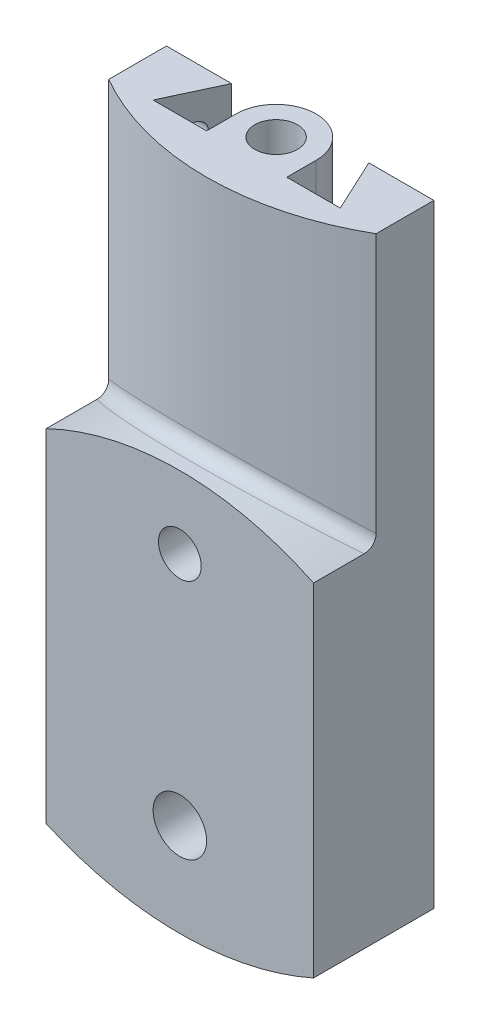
ISO-10303-21;
HEADER;
FILE_DESCRIPTION(('STEP AP214'),'2;1');
FILE_NAME('part.step','',(''),(''),'','','');
FILE_SCHEMA(('AUTOMOTIVE_DESIGN { 1 0 10303 214 1 1 1 1 }'));
ENDSEC;
DATA;
#1=APPLICATION_CONTEXT('core data for automotive mechanical design processes');
#2=APPLICATION_PROTOCOL_DEFINITION('international standard','automotive_design',2000,#1);
#3=PRODUCT_CONTEXT('',#1,'mechanical');
#4=PRODUCT('Part','Part','',(#3));
#5=PRODUCT_RELATED_PRODUCT_CATEGORY('part','',(#4));
#6=PRODUCT_DEFINITION_FORMATION('','',#4);
#7=PRODUCT_DEFINITION_CONTEXT('part definition',#1,'design');
#8=PRODUCT_DEFINITION('design','',#6,#7);
#9=PRODUCT_DEFINITION_SHAPE('','',#8);
#10=(LENGTH_UNIT() NAMED_UNIT(*) SI_UNIT(.MILLI.,.METRE.));
#11=(NAMED_UNIT(*) PLANE_ANGLE_UNIT() SI_UNIT($,.RADIAN.));
#12=(NAMED_UNIT(*) SI_UNIT($,.STERADIAN.) SOLID_ANGLE_UNIT());
#13=UNCERTAINTY_MEASURE_WITH_UNIT(LENGTH_MEASURE(1.E-05),#10,'distance_accuracy_value','');
#14=(GEOMETRIC_REPRESENTATION_CONTEXT(3) GLOBAL_UNCERTAINTY_ASSIGNED_CONTEXT((#13)) GLOBAL_UNIT_ASSIGNED_CONTEXT((#10,
#11,#12)) REPRESENTATION_CONTEXT('',''));
#15=CARTESIAN_POINT('',(0.,0.,0.));
#16=DIRECTION('',(0.,0.,1.));
#17=DIRECTION('',(1.,0.,0.));
#18=AXIS2_PLACEMENT_3D('',#15,#16,#17);
#19=CARTESIAN_POINT('',(-50.,120.,21.6025403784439));
#20=DIRECTION('',(1.,0.,0.));
#21=DIRECTION('',(0.,0.,-1.));
#22=AXIS2_PLACEMENT_3D('',#19,#20,#21);
#23=PLANE('',#22);
#24=CARTESIAN_POINT('',(-50.,-43.,9.));
#25=DIRECTION('',(-1.,0.,0.));
#26=DIRECTION('',(0.,0.,1.));
#27=AXIS2_PLACEMENT_3D('',#24,#25,#26);
#28=CIRCLE('',#27,2.99999999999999);
#29=CARTESIAN_POINT('',(-50.,-43.,12.));
#30=VERTEX_POINT('',#29);
#31=EDGE_CURVE('E341',#30,#30,#28,.T.);
#32=ORIENTED_EDGE('',*,*,#31,.F.);
#33=EDGE_LOOP('',(#32));
#34=FACE_BOUND('',#33,.T.);
#35=CARTESIAN_POINT('',(-50.,57.,9.));
#36=DIRECTION('',(-1.,0.,0.));
#37=DIRECTION('',(0.,0.,1.));
#38=AXIS2_PLACEMENT_3D('',#35,#36,#37);
#39=CIRCLE('',#38,2.99999999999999);
#40=CARTESIAN_POINT('',(-50.,57.,12.));
#41=VERTEX_POINT('',#40);
#42=EDGE_CURVE('E345',#41,#41,#39,.T.);
#43=ORIENTED_EDGE('',*,*,#42,.F.);
#44=EDGE_LOOP('',(#43));
#45=FACE_BOUND('',#44,.T.);
#46=DIRECTION('',(0.,-1.,0.));
#47=VECTOR('',#46,1.);
#48=CARTESIAN_POINT('',(-50.,120.,0.));
#49=LINE('',#48,#47);
#50=CARTESIAN_POINT('',(-50.,120.,0.));
#51=VERTEX_POINT('',#50);
#52=CARTESIAN_POINT('',(-50.0000000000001,-109.378823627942,0.));
#53=VERTEX_POINT('',#52);
#54=EDGE_CURVE('E189',#51,#53,#49,.T.);
#55=ORIENTED_EDGE('',*,*,#54,.T.);
#56=DIRECTION('',(0.,0.,-1.));
#57=VECTOR('',#56,1.);
#58=CARTESIAN_POINT('',(-50.0000000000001,-109.378823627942,327.931490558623));
#59=LINE('',#58,#57);
#60=CARTESIAN_POINT('',(-50.0000000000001,-109.378823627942,45.));
#61=VERTEX_POINT('',#60);
#62=EDGE_CURVE('E459',#61,#53,#59,.T.);
#63=ORIENTED_EDGE('',*,*,#62,.F.);
#64=DIRECTION('',(0.,1.,0.));
#65=VECTOR('',#64,1.);
#66=CARTESIAN_POINT('',(-50.,18.5615758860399,45.));
#67=LINE('',#66,#65);
#68=CARTESIAN_POINT('',(-50.,18.5615758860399,45.));
#69=VERTEX_POINT('',#68);
#70=EDGE_CURVE('E448',#61,#69,#67,.T.);
#71=ORIENTED_EDGE('',*,*,#70,.T.);
#72=DIRECTION('',(0.,0.,1.));
#73=VECTOR('',#72,1.);
#74=CARTESIAN_POINT('',(-50.,18.5615758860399,-500000.));
#75=LINE('',#74,#73);
#76=CARTESIAN_POINT('',(-50.,18.5615758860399,26.120155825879));
#77=VERTEX_POINT('',#76);
#78=EDGE_CURVE('E456',#77,#69,#75,.T.);
#79=ORIENTED_EDGE('',*,*,#78,.F.);
#80=CARTESIAN_POINT('',(80.6018966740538,-2.97357588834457,-2.14201908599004));
#81=CARTESIAN_POINT('',(79.2969225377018,-1.6912648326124,-4.05901764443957));
#82=CARTESIAN_POINT('',(80.1012637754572,0.592790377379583,-5.13525627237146));
#83=CARTESIAN_POINT('',(79.7583269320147,-2.14462942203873,-0.964297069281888));
#84=CARTESIAN_POINT('',(78.4275387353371,-0.863366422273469,-2.92731982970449));
#85=CARTESIAN_POINT('',(79.262933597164,1.45777799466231,-4.01361625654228));
#86=CARTESIAN_POINT('',(78.8904793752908,-1.31745890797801,0.195890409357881));
#87=CARTESIAN_POINT('',(77.5370746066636,-0.0415478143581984,-1.81829232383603));
#88=CARTESIAN_POINT('',(78.4004763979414,2.32091244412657,-2.90867580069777));
#89=CARTESIAN_POINT('',(77.1059102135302,0.32966685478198,2.48059138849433));
#90=CARTESIAN_POINT('',(75.7087619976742,1.59227394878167,0.362457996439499));
#91=CARTESIAN_POINT('',(76.6269915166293,4.03965237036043,-0.732770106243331));
#92=CARTESIAN_POINT('',(76.1891840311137,1.14962141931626,3.60510153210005));
#93=CARTESIAN_POINT('',(74.7703002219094,2.40440567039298,1.43415775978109));
#94=CARTESIAN_POINT('',(75.715959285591,4.89525713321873,0.338191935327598));
#95=CARTESIAN_POINT('',(74.3053274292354,2.77968037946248,5.81923183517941));
#96=CARTESIAN_POINT('',(72.8449063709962,4.01602728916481,3.54087837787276));
#97=CARTESIAN_POINT('',(73.8438036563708,6.59618822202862,2.44688746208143));
#98=CARTESIAN_POINT('',(73.3381255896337,3.58976870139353,6.90879883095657));
#99=CARTESIAN_POINT('',(71.8573099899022,4.81555308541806,4.57574916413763));
#100=CARTESIAN_POINT('',(72.8826092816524,7.44149777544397,3.48457031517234));
#101=CARTESIAN_POINT('',(71.354419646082,5.19520648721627,9.05001398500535));
#102=CARTESIAN_POINT('',(69.8353038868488,6.39706334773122,6.60593727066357));
#103=CARTESIAN_POINT('',(70.9112244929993,9.11673720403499,5.52382284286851));
#104=CARTESIAN_POINT('',(70.3379167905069,5.99055632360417,10.1016631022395));
#105=CARTESIAN_POINT('',(68.8003051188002,7.17904345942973,7.6011027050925));
#106=CARTESIAN_POINT('',(69.9010353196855,9.94666746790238,6.52539343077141));
#107=CARTESIAN_POINT('',(67.194881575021,8.36370077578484,13.2166204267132));
#108=CARTESIAN_POINT('',(65.5917007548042,9.51793303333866,10.5563653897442));
#109=CARTESIAN_POINT('',(66.7775220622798,12.4229921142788,9.49201945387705));
#110=CARTESIAN_POINT('',(64.9917651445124,9.91378435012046,15.2199487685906));
#111=CARTESIAN_POINT('',(63.3571032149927,11.031687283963,12.4393083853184));
#112=CARTESIAN_POINT('',(64.5880895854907,14.0404706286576,11.3999512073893));
#113=CARTESIAN_POINT('',(60.3842542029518,12.9095902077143,19.0489060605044));
#114=CARTESIAN_POINT('',(58.7069493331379,13.9441315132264,16.0236302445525));
#115=CARTESIAN_POINT('',(60.0091967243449,17.1665289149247,15.0465771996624));
#116=CARTESIAN_POINT('',(57.9799846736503,14.355376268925,20.8746438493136));
#117=CARTESIAN_POINT('',(56.287748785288,15.3409135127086,17.7219279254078));
#118=CARTESIAN_POINT('',(57.6198605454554,18.6751752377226,16.7853750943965));
#119=CARTESIAN_POINT('',(53.5299825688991,16.8060812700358,23.9431181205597));
#120=CARTESIAN_POINT('',(51.8431809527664,17.6926690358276,20.5582022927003));
#121=CARTESIAN_POINT('',(53.1974982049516,21.2324326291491,19.7077315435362));
#122=CARTESIAN_POINT('',(51.5236580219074,17.8374732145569,25.225136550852));
#123=CARTESIAN_POINT('',(49.8417080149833,18.6787816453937,21.7388896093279));
#124=CARTESIAN_POINT('',(51.2036353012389,22.3086677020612,20.9287014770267));
#125=CARTESIAN_POINT('',(47.3937645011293,19.8048719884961,27.6573593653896));
#126=CARTESIAN_POINT('',(45.7388582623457,20.5525993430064,23.970853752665));
#127=CARTESIAN_POINT('',(47.0993932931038,24.3616055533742,23.2451041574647));
#128=CARTESIAN_POINT('',(45.2701964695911,20.7408795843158,28.8075648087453));
#129=CARTESIAN_POINT('',(43.6374132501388,21.4382073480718,25.0194524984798));
#130=CARTESIAN_POINT('',(44.9890151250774,25.3383091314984,24.3405379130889));
#131=CARTESIAN_POINT('',(40.9195674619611,22.4991838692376,30.9588970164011));
#132=CARTESIAN_POINT('',(39.3502265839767,23.0955998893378,26.9738552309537));
#133=CARTESIAN_POINT('',(40.6654086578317,27.1730614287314,26.3894257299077));
#134=CARTESIAN_POINT('',(38.6928915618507,23.3218642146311,31.9605276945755));
#135=CARTESIAN_POINT('',(37.1658119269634,23.8653209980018,27.8771352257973));
#136=CARTESIAN_POINT('',(38.4525630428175,28.0315104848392,27.3433597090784));
#137=CARTESIAN_POINT('',(34.1386838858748,24.8422061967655,33.8053498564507));
#138=CARTESIAN_POINT('',(32.7158528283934,25.283107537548,29.5356831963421));
#139=CARTESIAN_POINT('',(33.9266423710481,29.6179542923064,29.1003331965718));
#140=CARTESIAN_POINT('',(31.8111645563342,25.5398832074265,34.6485608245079));
#141=CARTESIAN_POINT('',(30.4528460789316,25.9284625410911,30.2877070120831));
#142=CARTESIAN_POINT('',(31.6135796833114,30.345965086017,29.9033912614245));
#143=CARTESIAN_POINT('',(27.335623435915,26.7251240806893,36.0774346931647));
#144=CARTESIAN_POINT('',(26.119142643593,27.0213902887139,31.5582977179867));
#145=CARTESIAN_POINT('',(27.1658369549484,31.5827381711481,31.26422351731));
#146=CARTESIAN_POINT('',(25.1968887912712,27.2274992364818,36.6814043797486));
#147=CARTESIAN_POINT('',(24.056100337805,27.4816271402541,32.0919318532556));
#148=CARTESIAN_POINT('',(25.0403863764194,32.1069557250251,31.8394327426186));
#149=CARTESIAN_POINT('',(20.8624754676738,28.1134312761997,37.7447422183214));
#150=CARTESIAN_POINT('',(19.8854591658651,28.2920060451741,33.0301115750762));
#151=CARTESIAN_POINT('',(20.7328948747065,33.0314065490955,32.8521354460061));
#152=CARTESIAN_POINT('',(18.666801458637,28.4969978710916,38.2041221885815));
#153=CARTESIAN_POINT('',(17.7817222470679,28.6404204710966,33.4326436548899));
#154=CARTESIAN_POINT('',(18.5508585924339,33.4316499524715,33.2896401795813));
#155=CARTESIAN_POINT('',(14.2320974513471,29.137934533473,38.9709248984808));
#156=CARTESIAN_POINT('',(13.5394164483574,29.2224416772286,34.1044070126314));
#157=CARTESIAN_POINT('',(14.1436993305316,34.1004534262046,34.0199284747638));
#158=CARTESIAN_POINT('',(11.9930521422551,29.3952591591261,39.2782929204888));
#159=CARTESIAN_POINT('',(11.4055852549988,29.4546141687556,34.3719776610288));
#160=CARTESIAN_POINT('',(11.9185611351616,34.3689660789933,34.3126599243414));
#161=CARTESIAN_POINT('',(7.48892127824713,29.7781527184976,39.7354174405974));
#162=CARTESIAN_POINT('',(7.11503461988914,29.800486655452,34.7703969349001));
#163=CARTESIAN_POINT('',(7.44240623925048,34.7685071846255,34.7480166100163));
#164=CARTESIAN_POINT('',(5.22383505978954,29.9037182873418,39.8851699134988));
#165=CARTESIAN_POINT('',(4.96372158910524,29.9132938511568,34.9002161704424));
#166=CARTESIAN_POINT('',(5.19138887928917,34.8995321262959,34.8906380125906));
#167=CARTESIAN_POINT('',(0.634100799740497,30.0216765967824,40.025855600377));
#168=CARTESIAN_POINT('',(0.60098595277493,30.019568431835,35.022522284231));
#169=CARTESIAN_POINT('',(0.630162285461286,35.0226190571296,35.0246243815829));
#170=CARTESIAN_POINT('',(-1.69073231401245,30.0109822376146,40.0131071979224));
#171=CARTESIAN_POINT('',(-1.60454927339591,30.0099735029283,35.011485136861));
#172=CARTESIAN_POINT('',(-1.68023087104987,35.0114597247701,35.0124830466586));
#173=CARTESIAN_POINT('',(-6.32907480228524,29.8491550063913,39.8200844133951));
#174=CARTESIAN_POINT('',(-6.01425618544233,29.8641482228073,34.8436492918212));
#175=CARTESIAN_POINT('',(-6.28976377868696,34.8425965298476,34.8286518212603));
#176=CARTESIAN_POINT('',(-8.64258397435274,29.6980196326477,39.6398070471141));
#177=CARTESIAN_POINT('',(-8.21230598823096,29.728320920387,34.6873144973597));
#178=CARTESIAN_POINT('',(-8.58890332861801,34.6848900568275,34.6569590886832));
#179=CARTESIAN_POINT('',(-13.2382261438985,29.258810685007,39.1152957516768));
#180=CARTESIAN_POINT('',(-12.5927100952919,29.3312738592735,34.2298209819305));
#181=CARTESIAN_POINT('',(-13.1560011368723,34.2265850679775,34.1574245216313));
#182=CARTESIAN_POINT('',(-15.5203718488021,28.9707943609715,38.771130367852));
#183=CARTESIAN_POINT('',(-14.7693911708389,29.071163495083,33.9299421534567));
#184=CARTESIAN_POINT('',(-15.4239720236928,33.926046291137,33.8296479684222));
#185=CARTESIAN_POINT('',(-20.0369241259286,28.2640592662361,37.9251388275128));
#186=CARTESIAN_POINT('',(-19.0945571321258,28.4285466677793,33.1878536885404));
#187=CARTESIAN_POINT('',(-19.9124711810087,33.1885835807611,33.0239417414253));
#188=CARTESIAN_POINT('',(-22.2713302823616,27.8453393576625,37.4233112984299));
#189=CARTESIAN_POINT('',(-21.2381437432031,28.0476156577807,32.7474699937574));
#190=CARTESIAN_POINT('',(-22.1329990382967,32.7516584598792,32.5460107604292));
#191=CARTESIAN_POINT('',(-26.6634318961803,26.8887017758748,36.2741004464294));
#192=CARTESIAN_POINT('',(-25.4706447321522,27.1709222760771,31.7316753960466));
#193=CARTESIAN_POINT('',(-26.4978205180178,31.7534279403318,31.4515242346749));
#194=CARTESIAN_POINT('',(-28.8215241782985,26.351557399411,35.6276610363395));
#195=CARTESIAN_POINT('',(-27.5558620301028,26.6778133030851,31.1593684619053));
#196=CARTESIAN_POINT('',(-28.6425085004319,31.1929294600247,30.8358676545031));
#197=CARTESIAN_POINT('',(-33.063831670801,25.1663938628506,34.1971051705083));
#198=CARTESIAN_POINT('',(-31.6734723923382,25.5818644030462,29.8837550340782));
#199=CARTESIAN_POINT('',(-32.8584662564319,29.956237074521,29.4734334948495));
#200=CARTESIAN_POINT('',(-35.1480469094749,24.5183747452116,33.4129887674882));
#201=CARTESIAN_POINT('',(-33.7030990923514,24.9810437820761,29.1828328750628));
#202=CARTESIAN_POINT('',(-34.9297360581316,29.2800432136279,28.7266559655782));
#203=CARTESIAN_POINT('',(-39.2390582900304,23.1202215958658,31.7149938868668));
#204=CARTESIAN_POINT('',(-37.7042935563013,23.6756290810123,27.6544951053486));
#205=CARTESIAN_POINT('',(-38.9953374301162,27.8211007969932,27.1095179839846));
#206=CARTESIAN_POINT('',(-41.2456253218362,22.3698111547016,30.8007638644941));
#207=CARTESIAN_POINT('',(-39.674008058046,22.9727330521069,26.8291120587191));
#208=CARTESIAN_POINT('',(-40.9894413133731,27.0380638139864,26.2388227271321));
#209=CARTESIAN_POINT('',(-45.1685073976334,20.7794268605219,28.8545610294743));
#210=CARTESIAN_POINT('',(-43.540284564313,21.4733424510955,25.0607354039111));
#211=CARTESIAN_POINT('',(-44.8879576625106,25.378532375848,24.3852962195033));
#212=CARTESIAN_POINT('',(-47.0848186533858,19.9394492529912,27.8225832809));
#213=CARTESIAN_POINT('',(-45.4360437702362,20.6786730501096,24.1199840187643));
#214=CARTESIAN_POINT('',(-46.7923663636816,24.5020340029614,23.4024602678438));
#215=CARTESIAN_POINT('',(-51.5119534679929,17.8567372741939,25.2501999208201));
#216=CARTESIAN_POINT('',(-49.8209751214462,18.7013216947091,21.7668510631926));
#217=CARTESIAN_POINT('',(-51.1920034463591,22.3287693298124,20.9525713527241));
#218=CARTESIAN_POINT('',(-53.9815571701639,16.5796699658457,23.6625970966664));
#219=CARTESIAN_POINT('',(-52.2857606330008,17.4805222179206,20.3050788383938));
#220=CARTESIAN_POINT('',(-53.6462679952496,20.9961773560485,19.4405686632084));
#221=CARTESIAN_POINT('',(-58.7384291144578,13.9052539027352,20.3067519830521));
#222=CARTESIAN_POINT('',(-57.0517736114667,14.9051924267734,17.1925424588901));
#223=CARTESIAN_POINT('',(-58.3735941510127,18.2054823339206,16.2445256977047));
#224=CARTESIAN_POINT('',(-61.0255616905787,12.5078172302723,18.5383774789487));
#225=CARTESIAN_POINT('',(-59.3549532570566,13.5534144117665,15.5455737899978));
#226=CARTESIAN_POINT('',(-60.6465209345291,16.7472875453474,14.560359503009));
#227=CARTESIAN_POINT('',(-64.3081931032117,10.347559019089,15.7722702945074));
#228=CARTESIAN_POINT('',(-62.6847009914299,11.4423307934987,12.9427531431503));
#229=CARTESIAN_POINT('',(-63.9087633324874,14.4931050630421,11.9259717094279));
#230=CARTESIAN_POINT('',(-65.3742057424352,9.61948192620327,14.8348317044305));
#231=CARTESIAN_POINT('',(-63.7633706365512,10.7324193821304,12.0627582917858));
#232=CARTESIAN_POINT('',(-64.968154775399,13.7333724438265,11.033173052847));
#233=CARTESIAN_POINT('',(-67.4605024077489,8.14350779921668,12.9220438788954));
#234=CARTESIAN_POINT('',(-65.8773778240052,9.28993728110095,10.2630241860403));
#235=CARTESIAN_POINT('',(-67.0414930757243,12.193225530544,9.2114703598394));
#236=CARTESIAN_POINT('',(-68.4807848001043,7.3956100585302,11.9466932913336));
#237=CARTESIAN_POINT('',(-66.9131757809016,8.55749949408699,9.34354896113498));
#238=CARTESIAN_POINT('',(-68.0554383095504,11.4128104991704,8.28256503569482));
#239=CARTESIAN_POINT('',(-70.4739282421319,5.88446994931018,9.96148793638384));
#240=CARTESIAN_POINT('',(-68.9391336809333,7.07445981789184,7.46810234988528));
#241=CARTESIAN_POINT('',(-70.0362019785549,9.83596864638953,6.39189326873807));
#242=CARTESIAN_POINT('',(-71.4468654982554,5.12125523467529,8.95169338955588));
#243=CARTESIAN_POINT('',(-69.9298511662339,6.32396611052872,6.51240318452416));
#244=CARTESIAN_POINT('',(-71.0030961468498,9.03957068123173,5.43018417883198));
#245=CARTESIAN_POINT('',(-73.3472165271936,3.5814974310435,6.89744089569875));
#246=CARTESIAN_POINT('',(-71.866967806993,4.80710631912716,4.56459219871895));
#247=CARTESIAN_POINT('',(-72.891643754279,7.43286688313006,3.47375323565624));
#248=CARTESIAN_POINT('',(-74.2746360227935,2.80495603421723,5.85298733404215));
#249=CARTESIAN_POINT('',(-72.8138924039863,4.04074558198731,3.57261935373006));
#250=CARTESIAN_POINT('',(-73.8133028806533,6.62256281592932,2.47903555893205));
#251=CARTESIAN_POINT('',(-75.1794607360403,2.02326518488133,4.79176482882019));
#252=CARTESIAN_POINT('',(-73.7422763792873,3.26484977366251,2.55891774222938));
#253=CARTESIAN_POINT('',(-74.7125075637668,5.80688541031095,1.46834745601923));
#254=(BOUNDED_SURFACE() B_SPLINE_SURFACE(3,2,((#80,#81,#82),(#83,#84,#85),(#86,#87,#88),(#89,
#90,#91),(#92,#93,#94),(#95,#96,#97),(#98,#99,#100),(#101,#102,#103),(#104,#105,#106),(#107,
#108,#109),(#110,#111,#112),(#113,#114,#115),(#116,#117,#118),(#119,#120,#121),(#122,#123,#124),
(#125,#126,#127),(#128,#129,#130),(#131,#132,#133),(#134,#135,#136),(#137,#138,#139),(#140,#141,
#142),(#143,#144,#145),(#146,#147,#148),(#149,#150,#151),(#152,#153,#154),(#155,#156,#157),
(#158,#159,#160),(#161,#162,#163),(#164,#165,#166),(#167,#168,#169),(#170,#171,#172),(#173,#174,
#175),(#176,#177,#178),(#179,#180,#181),(#182,#183,#184),(#185,#186,#187),(#188,#189,#190),
(#191,#192,#193),(#194,#195,#196),(#197,#198,#199),(#200,#201,#202),(#203,#204,#205),(#206,#207,
#208),(#209,#210,#211),(#212,#213,#214),(#215,#216,#217),(#218,#219,#220),(#221,#222,#223),
(#224,#225,#226),(#227,#228,#229),(#230,#231,#232),(#233,#234,#235),(#236,#237,#238),(#239,#240,
#241),(#242,#243,#244),(#245,#246,#247),(#248,#249,#250),(#251,#252,#253)),.UNSPECIFIED.,.F.,
.F.,.F.) B_SPLINE_SURFACE_WITH_KNOTS((4,2,2,2,2,2,2,2,2,2,2,2,2,2,2,2,2,2,2,2,2,2,2,2,2,2,2,2,
4),(3,3),(0.,5.1174295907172,10.2353392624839,15.3606979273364,20.4859268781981,
30.8286370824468,41.1649681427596,49.1991985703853,57.233364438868,65.2396255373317,
73.2449012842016,80.3490499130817,87.4526177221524,94.5587406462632,101.665045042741,
108.932630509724,116.200345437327,123.465023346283,130.729764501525,137.948403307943,
145.167039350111,152.4055628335,159.64438986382,169.55140981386,179.465728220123,
184.388112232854,189.310671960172,194.225026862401,199.138762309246),(0.,1.),
.UNSPECIFIED.) GEOMETRIC_REPRESENTATION_ITEM() RATIONAL_B_SPLINE_SURFACE(((1.,0.88357755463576,
1.),(1.,0.880252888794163,1.),(1.,0.876865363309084,1.),(1.,0.869979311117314,1.),(1.,
0.866480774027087,1.),(1.,0.859382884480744,1.),(1.,0.855783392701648,1.),(1.,0.848506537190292,
1.),(1.,0.844829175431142,1.),(1.,0.833640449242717,1.),(1.,0.82603700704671,1.),(1.,
0.810788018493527,1.),(1.,0.803142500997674,1.),(1.,0.789735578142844,1.),(1.,0.78393379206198,
1.),(1.,0.772593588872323,1.),(1.,0.767055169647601,1.),(1.,0.756421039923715,1.),(1.,
0.751323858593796,1.),(1.,0.741725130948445,1.),(1.,0.737223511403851,1.),(1.,0.729457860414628,
1.),(1.,0.726111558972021,1.),(1.,0.720147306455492,1.),(1.,0.717529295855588,1.),(1.,
0.713122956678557,1.),(1.,0.711334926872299,1.),(1.,0.708664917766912,1.),(1.,0.707782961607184,
1.),(1.,0.706954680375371,1.),(1.,0.707030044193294,1.),(1.,0.708165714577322,1.),(1.,
0.70922603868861,1.),(1.,0.712282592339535,1.),(1.,0.714278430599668,1.),(1.,0.719119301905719,
1.),(1.,0.721964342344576,1.),(1.,0.728369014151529,1.),(1.,0.731923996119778,1.),(1.,
0.739632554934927,1.),(1.,0.743786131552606,1.),(1.,0.752572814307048,1.),(1.,0.757207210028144,
1.),(1.,0.766818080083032,1.),(1.,0.771794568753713,1.),(1.,0.783848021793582,1.),(1.,
0.79102309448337,1.),(1.,0.80553403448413,1.),(1.,0.812870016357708,1.),(1.,0.823803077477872,
1.),(1.,0.827422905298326,1.),(1.,0.834627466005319,1.),(1.,0.838212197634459,1.),(1.,
0.845320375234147,1.),(1.,0.848843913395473,1.),(1.,0.855818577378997,1.),(1.,0.8592697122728,
1.),(1.,0.86267647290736,1.))) REPRESENTATION_ITEM('') SURFACE());
#255=CARTESIAN_POINT('',(-49.9999999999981,18.5615758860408,26.1201558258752));
#256=CARTESIAN_POINT('',(-49.9999999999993,18.561566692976,25.9832842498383));
#257=CARTESIAN_POINT('',(-49.9999999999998,18.5664545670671,25.8463721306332));
#258=CARTESIAN_POINT('',(-50.0000000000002,18.5864800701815,25.5731847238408));
#259=CARTESIAN_POINT('',(-50.,18.6016267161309,25.4369101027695));
#260=CARTESIAN_POINT('',(-49.9999999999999,18.6427864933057,25.164905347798));
#261=CARTESIAN_POINT('',(-50.,18.6688832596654,25.0291877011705));
#262=CARTESIAN_POINT('',(-50.,18.7323614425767,24.7604378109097));
#263=CARTESIAN_POINT('',(-50.,18.7697400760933,24.6274049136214));
#264=CARTESIAN_POINT('',(-50.,18.8563223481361,24.3643545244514));
#265=CARTESIAN_POINT('',(-50.,18.9055943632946,24.2343594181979));
#266=CARTESIAN_POINT('',(-50.,19.0160307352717,23.9795238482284));
#267=CARTESIAN_POINT('',(-50.,19.0771933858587,23.8546826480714));
#268=CARTESIAN_POINT('',(-50.,19.2111259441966,23.6119266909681));
#269=CARTESIAN_POINT('',(-50.,19.2838556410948,23.493989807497));
#270=CARTESIAN_POINT('',(-50.,19.4407814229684,23.2660126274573));
#271=CARTESIAN_POINT('',(-50.,19.5249755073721,23.1559709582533));
#272=CARTESIAN_POINT('',(-50.,19.6932789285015,22.9579652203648));
#273=CARTESIAN_POINT('',(-50.,19.7761485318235,22.8689448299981));
#274=CARTESIAN_POINT('',(-50.,19.9496848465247,22.6988650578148));
#275=CARTESIAN_POINT('',(-50.,20.0403507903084,22.6178048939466));
#276=CARTESIAN_POINT('',(-50.,20.2287573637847,22.4643157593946));
#277=CARTESIAN_POINT('',(-50.,20.3265000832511,22.3918893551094));
#278=CARTESIAN_POINT('',(-50.,20.528181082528,22.2562583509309));
#279=CARTESIAN_POINT('',(-50.,20.6321191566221,22.1930534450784));
#280=CARTESIAN_POINT('',(-50.,20.8369791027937,22.0807305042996));
#281=CARTESIAN_POINT('',(-50.,20.9375123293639,22.0309009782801));
#282=CARTESIAN_POINT('',(-50.,21.1423171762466,21.9395341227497));
#283=CARTESIAN_POINT('',(-50.,21.2465900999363,21.8979997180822));
#284=CARTESIAN_POINT('',(-50.,21.4580735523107,21.8232601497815));
#285=CARTESIAN_POINT('',(-50.,21.5652841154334,21.7900550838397));
#286=CARTESIAN_POINT('',(-50.,21.7819292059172,21.7318939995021));
#287=CARTESIAN_POINT('',(-50.,21.8913641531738,21.7069395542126));
#288=CARTESIAN_POINT('',(-50.,22.1507833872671,21.6577077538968));
#289=CARTESIAN_POINT('',(-50.,22.3014105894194,21.6367960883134));
#290=CARTESIAN_POINT('',(-50.,22.6034657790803,21.6092182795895));
#291=CARTESIAN_POINT('',(-50.,22.7548893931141,21.6025046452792));
#292=CARTESIAN_POINT('',(-50.,22.9062092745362,21.602540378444));
#293=B_SPLINE_CURVE_WITH_KNOTS('',3,(#255,#256,#257,#258,#259,#260,#261,#262,#263,#264,#265,
#266,#267,#268,#269,#270,#271,#272,#273,#274,#275,#276,#277,#278,#279,#280,#281,#282,#283,#284,
#285,#286,#287,#288,#289,#290,#291,#292),.UNSPECIFIED.,.F.,.F.,(4,2,2,2,2,2,2,2,2,2,2,2,2,2,2,2,
2,2,4),(0.,0.410587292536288,0.821535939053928,1.23568217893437,1.6497263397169,
2.06621009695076,2.48263413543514,2.89764097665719,3.312575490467,3.67695034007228,
4.04128935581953,4.40573640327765,4.77017135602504,5.10641489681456,5.44277678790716,
5.77914262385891,6.11557255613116,6.57107682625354,7.02505504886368),.UNSPECIFIED.);
#294=CARTESIAN_POINT('',(-50.,22.9062092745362,21.6025403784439));
#295=VERTEX_POINT('',#294);
#296=EDGE_CURVE('E11',#77,#295,#293,.T.);
#297=ORIENTED_EDGE('',*,*,#296,.T.);
#298=DIRECTION('',(0.,-1.,0.));
#299=VECTOR('',#298,1.);
#300=CARTESIAN_POINT('',(-50.,120.,21.6025403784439));
#301=LINE('',#300,#299);
#302=CARTESIAN_POINT('',(-50.,120.,21.6025403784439));
#303=VERTEX_POINT('',#302);
#304=EDGE_CURVE('E483',#303,#295,#301,.T.);
#305=ORIENTED_EDGE('',*,*,#304,.F.);
#306=DIRECTION('',(0.,0.,1.));
#307=VECTOR('',#306,1.);
#308=CARTESIAN_POINT('',(-50.,120.,21.6025403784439));
#309=LINE('',#308,#307);
#310=EDGE_CURVE('E477',#51,#303,#309,.T.);
#311=ORIENTED_EDGE('',*,*,#310,.F.);
#312=EDGE_LOOP('',(#55,#63,#71,#79,#297,#305,#311));
#313=FACE_BOUND('',#312,.T.);
#314=CARTESIAN_POINT('',(-50.,107.,9.));
#315=DIRECTION('',(-1.,0.,0.));
#316=DIRECTION('',(0.,0.,1.));
#317=AXIS2_PLACEMENT_3D('',#314,#315,#316);
#318=CIRCLE('',#317,2.99999999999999);
#319=CARTESIAN_POINT('',(-50.,107.,12.));
#320=VERTEX_POINT('',#319);
#321=EDGE_CURVE('E353',#320,#320,#318,.T.);
#322=ORIENTED_EDGE('',*,*,#321,.F.);
#323=EDGE_LOOP('',(#322));
#324=FACE_BOUND('',#323,.T.);
#325=CARTESIAN_POINT('',(-50.,6.99999999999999,9.));
#326=DIRECTION('',(-1.,0.,0.));
#327=DIRECTION('',(0.,0.,1.));
#328=AXIS2_PLACEMENT_3D('',#325,#326,#327);
#329=CIRCLE('',#328,2.99999999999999);
#330=CARTESIAN_POINT('',(-50.,6.99999999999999,12.));
#331=VERTEX_POINT('',#330);
#332=EDGE_CURVE('E357',#331,#331,#329,.T.);
#333=ORIENTED_EDGE('',*,*,#332,.F.);
#334=EDGE_LOOP('',(#333));
#335=FACE_BOUND('',#334,.T.);
#336=CARTESIAN_POINT('',(-50.0000000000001,-93.,9.));
#337=DIRECTION('',(-1.,0.,0.));
#338=DIRECTION('',(0.,0.,1.));
#339=AXIS2_PLACEMENT_3D('',#336,#337,#338);
#340=CIRCLE('',#339,2.99999999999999);
#341=CARTESIAN_POINT('',(-50.0000000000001,-93.,12.));
#342=VERTEX_POINT('',#341);
#343=EDGE_CURVE('E252',#342,#342,#340,.T.);
#344=ORIENTED_EDGE('',*,*,#343,.F.);
#345=EDGE_LOOP('',(#344));
#346=FACE_BOUND('',#345,.T.);
#347=ADVANCED_FACE('F26',(#34,#45,#313,#324,#335,#346),#23,.F.);
#348=CARTESIAN_POINT('',(35.,-120.,20.));
#349=DIRECTION('',(0.,0.,1.));
#350=DIRECTION('',(1.,0.,0.));
#351=AXIS2_PLACEMENT_3D('',#348,#349,#350);
#352=PLANE('',#351);
#353=CARTESIAN_POINT('',(0.,3.,20.));
#354=DIRECTION('',(0.,0.,1.));
#355=DIRECTION('',(1.,0.,0.));
#356=AXIS2_PLACEMENT_3D('',#353,#354,#355);
#357=CIRCLE('',#356,123.);
#358=CARTESIAN_POINT('',(15.,-119.081939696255,20.));
#359=VERTEX_POINT('',#358);
#360=CARTESIAN_POINT('',(35.,-114.915223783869,20.));
#361=VERTEX_POINT('',#360);
#362=EDGE_CURVE('E171',#359,#361,#357,.T.);
#363=ORIENTED_EDGE('',*,*,#362,.F.);
#364=DIRECTION('',(0.,-1.,0.));
#365=VECTOR('',#364,1.);
#366=CARTESIAN_POINT('',(15.,95.,20.));
#367=LINE('',#366,#365);
#368=CARTESIAN_POINT('',(15.,95.,20.));
#369=VERTEX_POINT('',#368);
#370=EDGE_CURVE('E153',#369,#359,#367,.T.);
#371=ORIENTED_EDGE('',*,*,#370,.F.);
#372=DIRECTION('',(0.,1.,0.));
#373=VECTOR('',#372,1.);
#374=CARTESIAN_POINT('',(15.,95.,20.));
#375=LINE('',#374,#373);
#376=CARTESIAN_POINT('',(15.,120.,20.));
#377=VERTEX_POINT('',#376);
#378=EDGE_CURVE('E419',#369,#377,#375,.T.);
#379=ORIENTED_EDGE('',*,*,#378,.T.);
#380=DIRECTION('',(1.,0.,0.));
#381=VECTOR('',#380,1.);
#382=CARTESIAN_POINT('',(35.,120.,20.));
#383=LINE('',#382,#381);
#384=CARTESIAN_POINT('',(35.,120.,20.));
#385=VERTEX_POINT('',#384);
#386=EDGE_CURVE('E433',#377,#385,#383,.T.);
#387=ORIENTED_EDGE('',*,*,#386,.T.);
#388=DIRECTION('',(0.,1.,0.));
#389=VECTOR('',#388,1.);
#390=CARTESIAN_POINT('',(35.,-120.,20.));
#391=LINE('',#390,#389);
#392=EDGE_CURVE('E182',#361,#385,#391,.T.);
#393=ORIENTED_EDGE('',*,*,#392,.F.);
#394=EDGE_LOOP('',(#363,#371,#379,#387,#393));
#395=FACE_BOUND('',#394,.T.);
#396=ADVANCED_FACE('F180',(#395),#352,.F.);
#397=CARTESIAN_POINT('',(-50.,120.,0.));
#398=DIRECTION('',(0.,0.,1.));
#399=DIRECTION('',(1.,0.,0.));
#400=AXIS2_PLACEMENT_3D('',#397,#398,#399);
#401=PLANE('',#400);
#402=CARTESIAN_POINT('',(0.,3.,0.));
#403=DIRECTION('',(0.,0.,1.));
#404=DIRECTION('',(1.,0.,0.));
#405=AXIS2_PLACEMENT_3D('',#402,#403,#404);
#406=CIRCLE('',#405,123.);
#407=CARTESIAN_POINT('',(49.9999999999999,-109.378823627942,0.));
#408=VERTEX_POINT('',#407);
#409=CARTESIAN_POINT('',(25.6738468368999,-117.290704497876,0.));
#410=VERTEX_POINT('',#409);
#411=EDGE_CURVE('E467',#408,#410,#406,.F.);
#412=ORIENTED_EDGE('',*,*,#411,.T.);
#413=DIRECTION('',(0.,1.,0.));
#414=VECTOR('',#413,1.);
#415=CARTESIAN_POINT('',(25.6738468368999,-120.,0.));
#416=LINE('',#415,#414);
#417=CARTESIAN_POINT('',(25.6738468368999,120.,0.));
#418=VERTEX_POINT('',#417);
#419=EDGE_CURVE('E436',#410,#418,#416,.T.);
#420=ORIENTED_EDGE('',*,*,#419,.T.);
#421=DIRECTION('',(-1.,0.,0.));
#422=VECTOR('',#421,1.);
#423=CARTESIAN_POINT('',(-50.,120.,0.));
#424=LINE('',#423,#422);
#425=CARTESIAN_POINT('',(50.,120.,0.));
#426=VERTEX_POINT('',#425);
#427=EDGE_CURVE('E474',#426,#418,#424,.T.);
#428=ORIENTED_EDGE('',*,*,#427,.F.);
#429=DIRECTION('',(0.,-1.,0.));
#430=VECTOR('',#429,1.);
#431=CARTESIAN_POINT('',(50.,120.,0.));
#432=LINE('',#431,#430);
#433=EDGE_CURVE('E184',#426,#408,#432,.T.);
#434=ORIENTED_EDGE('',*,*,#433,.T.);
#435=EDGE_LOOP('',(#412,#420,#428,#434));
#436=FACE_BOUND('',#435,.T.);
#437=ADVANCED_FACE('F226',(#436),#401,.F.);
#438=CARTESIAN_POINT('',(0.,120.,-65.));
#439=DIRECTION('',(0.,-1.,0.));
#440=DIRECTION('',(0.,0.,-1.));
#441=AXIS2_PLACEMENT_3D('',#438,#439,#440);
#442=CYLINDRICAL_SURFACE('',#441,100.);
#443=ORIENTED_EDGE('',*,*,#304,.T.);
#444=CARTESIAN_POINT('',(-74.7125075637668,5.80688541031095,1.46834745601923));
#445=CARTESIAN_POINT('',(-73.8133028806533,6.62256281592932,2.47903555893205));
#446=CARTESIAN_POINT('',(-72.891643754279,7.43286688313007,3.47375323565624));
#447=CARTESIAN_POINT('',(-71.0030961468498,9.03957068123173,5.43018417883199));
#448=CARTESIAN_POINT('',(-70.0362019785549,9.83596864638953,6.39189326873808));
#449=CARTESIAN_POINT('',(-68.0554383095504,11.4128104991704,8.28256503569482));
#450=CARTESIAN_POINT('',(-67.0414930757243,12.193225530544,9.21147035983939));
#451=CARTESIAN_POINT('',(-64.968154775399,13.7333724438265,11.033173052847));
#452=CARTESIAN_POINT('',(-63.9087633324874,14.4931050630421,11.9259717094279));
#453=CARTESIAN_POINT('',(-60.6465209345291,16.7472875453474,14.560359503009));
#454=CARTESIAN_POINT('',(-58.3735941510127,18.2054823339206,16.2445256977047));
#455=CARTESIAN_POINT('',(-53.6462679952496,20.9961773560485,19.4405686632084));
#456=CARTESIAN_POINT('',(-51.1920034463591,22.3287693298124,20.9525713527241));
#457=CARTESIAN_POINT('',(-46.7923663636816,24.5020340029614,23.4024602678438));
#458=CARTESIAN_POINT('',(-44.8879576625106,25.378532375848,24.3852962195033));
#459=CARTESIAN_POINT('',(-40.9894413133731,27.0380638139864,26.2388227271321));
#460=CARTESIAN_POINT('',(-38.9953374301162,27.8211007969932,27.1095179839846));
#461=CARTESIAN_POINT('',(-34.9297360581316,29.2800432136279,28.7266559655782));
#462=CARTESIAN_POINT('',(-32.8584662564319,29.956237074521,29.4734334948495));
#463=CARTESIAN_POINT('',(-28.6425085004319,31.1929294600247,30.8358676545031));
#464=CARTESIAN_POINT('',(-26.4978205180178,31.7534279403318,31.4515242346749));
#465=CARTESIAN_POINT('',(-22.1329990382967,32.7516584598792,32.5460107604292));
#466=CARTESIAN_POINT('',(-19.9124711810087,33.1885835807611,33.0239417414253));
#467=CARTESIAN_POINT('',(-15.4239720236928,33.926046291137,33.8296479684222));
#468=CARTESIAN_POINT('',(-13.1560011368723,34.2265850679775,34.1574245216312));
#469=CARTESIAN_POINT('',(-8.588903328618,34.6848900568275,34.6569590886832));
#470=CARTESIAN_POINT('',(-6.28976377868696,34.8425965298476,34.8286518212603));
#471=CARTESIAN_POINT('',(-1.68023087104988,35.0114597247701,35.0124830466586));
#472=CARTESIAN_POINT('',(0.630162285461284,35.0226190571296,35.0246243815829));
#473=CARTESIAN_POINT('',(5.19138887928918,34.8995321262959,34.8906380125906));
#474=CARTESIAN_POINT('',(7.44240623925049,34.7685071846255,34.7480166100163));
#475=CARTESIAN_POINT('',(11.9185611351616,34.3689660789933,34.3126599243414));
#476=CARTESIAN_POINT('',(14.1436993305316,34.1004534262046,34.0199284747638));
#477=CARTESIAN_POINT('',(18.5508585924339,33.4316499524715,33.2896401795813));
#478=CARTESIAN_POINT('',(20.7328948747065,33.0314065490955,32.8521354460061));
#479=CARTESIAN_POINT('',(25.0403863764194,32.1069557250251,31.8394327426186));
#480=CARTESIAN_POINT('',(27.1658369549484,31.5827381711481,31.26422351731));
#481=CARTESIAN_POINT('',(31.6135796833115,30.345965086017,29.9033912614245));
#482=CARTESIAN_POINT('',(33.9266423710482,29.6179542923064,29.1003331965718));
#483=CARTESIAN_POINT('',(38.4525630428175,28.0315104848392,27.3433597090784));
#484=CARTESIAN_POINT('',(40.6654086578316,27.1730614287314,26.3894257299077));
#485=CARTESIAN_POINT('',(44.9890151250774,25.3383091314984,24.3405379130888));
#486=CARTESIAN_POINT('',(47.0993932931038,24.3616055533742,23.2451041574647));
#487=CARTESIAN_POINT('',(51.2036353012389,22.3086677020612,20.9287014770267));
#488=CARTESIAN_POINT('',(53.1974982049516,21.2324326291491,19.7077315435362));
#489=CARTESIAN_POINT('',(57.6198605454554,18.6751752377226,16.7853750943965));
#490=CARTESIAN_POINT('',(60.0091967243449,17.1665289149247,15.0465771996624));
#491=CARTESIAN_POINT('',(64.5880895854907,14.0404706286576,11.3999512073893));
#492=CARTESIAN_POINT('',(66.7775220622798,12.4229921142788,9.49201945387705));
#493=CARTESIAN_POINT('',(69.9010353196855,9.94666746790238,6.52539343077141));
#494=CARTESIAN_POINT('',(70.9112244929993,9.11673720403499,5.52382284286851));
#495=CARTESIAN_POINT('',(72.8826092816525,7.44149777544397,3.48457031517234));
#496=CARTESIAN_POINT('',(73.8438036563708,6.59618822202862,2.44688746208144));
#497=CARTESIAN_POINT('',(75.715959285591,4.89525713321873,0.338191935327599));
#498=CARTESIAN_POINT('',(76.6269915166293,4.03965237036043,-0.732770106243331));
#499=CARTESIAN_POINT('',(78.4004763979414,2.32091244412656,-2.90867580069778));
#500=CARTESIAN_POINT('',(79.262933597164,1.45777799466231,-4.01361625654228));
#501=CARTESIAN_POINT('',(80.1012637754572,0.592790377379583,-5.13525627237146));
#502=B_SPLINE_CURVE_WITH_KNOTS('',3,(#444,#445,#446,#447,#448,#449,#450,#451,#452,#453,#454,
#455,#456,#457,#458,#459,#460,#461,#462,#463,#464,#465,#466,#467,#468,#469,#470,#471,#472,#473,
#474,#475,#476,#477,#478,#479,#480,#481,#482,#483,#484,#485,#486,#487,#488,#489,#490,#491,#492,
#493,#494,#495,#496,#497,#498,#499,#500,#501),.UNSPECIFIED.,.F.,.F.,(4,2,2,2,2,2,2,2,2,2,2,2,2,
2,2,2,2,2,2,2,2,2,2,2,2,2,2,2,4),(0.,4.91373544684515,9.82809034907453,14.7506500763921,
19.6730340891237,29.5873524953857,39.4943724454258,46.7331994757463,53.9717229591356,
61.1903590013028,68.4089978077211,75.6737389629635,82.9384168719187,90.2061317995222,
97.4737172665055,104.580021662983,111.686144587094,118.789712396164,125.893861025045,
133.899136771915,141.905397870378,149.939563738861,157.973794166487,168.310125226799,
178.652835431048,183.77806438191,188.903423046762,194.021332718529,199.138762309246),.UNSPECIFIED.);
#503=CARTESIAN_POINT('',(50.,22.9062092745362,21.6025403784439));
#504=VERTEX_POINT('',#503);
#505=EDGE_CURVE('E197',#295,#504,#502,.T.);
#506=ORIENTED_EDGE('',*,*,#505,.T.);
#507=DIRECTION('',(0.,-1.,0.));
#508=VECTOR('',#507,1.);
#509=CARTESIAN_POINT('',(50.,120.,21.6025403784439));
#510=LINE('',#509,#508);
#511=CARTESIAN_POINT('',(50.,120.,21.6025403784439));
#512=VERTEX_POINT('',#511);
#513=EDGE_CURVE('E481',#512,#504,#510,.T.);
#514=ORIENTED_EDGE('',*,*,#513,.F.);
#515=CARTESIAN_POINT('',(0.,120.,-65.));
#516=DIRECTION('',(0.,1.,0.));
#517=DIRECTION('',(0.,0.,1.));
#518=AXIS2_PLACEMENT_3D('',#515,#516,#517);
#519=CIRCLE('',#518,100.);
#520=EDGE_CURVE('E479',#303,#512,#519,.T.);
#521=ORIENTED_EDGE('',*,*,#520,.F.);
#522=EDGE_LOOP('',(#443,#506,#514,#521));
#523=FACE_BOUND('',#522,.T.);
#524=ADVANCED_FACE('F221',(#523),#442,.T.);
#525=CARTESIAN_POINT('',(50.,120.,21.6025403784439));
#526=DIRECTION('',(-1.,0.,0.));
#527=DIRECTION('',(0.,0.,1.));
#528=AXIS2_PLACEMENT_3D('',#525,#526,#527);
#529=PLANE('',#528);
#530=ORIENTED_EDGE('',*,*,#513,.T.);
#531=CARTESIAN_POINT('',(50.,22.9062092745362,21.6025403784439));
#532=CARTESIAN_POINT('',(50.,22.7821565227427,21.6025333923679));
#533=CARTESIAN_POINT('',(50.,22.6580686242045,21.6070366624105));
#534=CARTESIAN_POINT('',(50.,22.4105037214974,21.6254409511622));
#535=CARTESIAN_POINT('',(50.,22.2870272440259,21.6393490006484));
#536=CARTESIAN_POINT('',(50.,22.0410102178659,21.6770245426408));
#537=CARTESIAN_POINT('',(50.,21.9184762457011,21.7008354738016));
#538=CARTESIAN_POINT('',(50.,21.6758369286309,21.7585839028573));
#539=CARTESIAN_POINT('',(50.,21.5557310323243,21.7925190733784));
#540=CARTESIAN_POINT('',(50.,21.318329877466,21.8708735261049));
#541=CARTESIAN_POINT('',(50.,21.2010510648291,21.9153428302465));
#542=CARTESIAN_POINT('',(50.,20.9709745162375,22.0146613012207));
#543=CARTESIAN_POINT('',(50.,20.8581764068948,22.0695096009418));
#544=CARTESIAN_POINT('',(50.,20.6383822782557,22.1892608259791));
#545=CARTESIAN_POINT('',(50.,20.5313733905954,22.2541401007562));
#546=CARTESIAN_POINT('',(50.,20.3239107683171,22.3936393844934));
#547=CARTESIAN_POINT('',(50.,20.2234563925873,22.4682584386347));
#548=CARTESIAN_POINT('',(50.,20.037754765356,22.6203278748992));
#549=CARTESIAN_POINT('',(50.,19.9519335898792,22.6970788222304));
#550=CARTESIAN_POINT('',(50.,19.7872284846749,22.8577454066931));
#551=CARTESIAN_POINT('',(50.,19.7083468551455,22.9416634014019));
#552=CARTESIAN_POINT('',(50.,19.5580622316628,23.1159455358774));
#553=CARTESIAN_POINT('',(50.,19.4866590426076,23.2063095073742));
#554=CARTESIAN_POINT('',(50.,19.3516717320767,23.3927168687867));
#555=CARTESIAN_POINT('',(50.,19.2880905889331,23.4887624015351));
#556=CARTESIAN_POINT('',(50.,19.111255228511,23.781301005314));
#557=CARTESIAN_POINT('',(50.,19.0095792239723,23.9849316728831));
#558=CARTESIAN_POINT('',(50.,18.8379284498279,24.4051676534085));
#559=CARTESIAN_POINT('',(50.,18.7679896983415,24.6217873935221));
#560=CARTESIAN_POINT('',(50.,18.6615504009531,25.0512693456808));
#561=CARTESIAN_POINT('',(50.,18.6235316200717,25.2637633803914));
#562=CARTESIAN_POINT('',(50.,18.573576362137,25.690985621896));
#563=CARTESIAN_POINT('',(50.,18.5615375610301,25.9057017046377));
#564=CARTESIAN_POINT('',(50.,18.5615758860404,26.1201558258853));
#565=B_SPLINE_CURVE_WITH_KNOTS('',3,(#531,#532,#533,#534,#535,#536,#537,#538,#539,#540,#541,
#542,#543,#544,#545,#546,#547,#548,#549,#550,#551,#552,#553,#554,#555,#556,#557,#558,#559,#560,
#561,#562,#563,#564),.UNSPECIFIED.,.F.,.F.,(4,2,2,2,2,2,2,2,2,2,2,2,2,2,2,2,4),(0.,
0.372128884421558,0.744536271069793,1.11859473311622,1.49256727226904,1.86835255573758,
2.24410645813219,2.61898756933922,2.99383195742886,3.33880656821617,3.68389509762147,
4.02897462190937,4.37418513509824,5.05395723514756,5.73449888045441,6.38046743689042,
7.02388711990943),.UNSPECIFIED.);
#566=CARTESIAN_POINT('',(50.,18.5615758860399,26.120155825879));
#567=VERTEX_POINT('',#566);
#568=EDGE_CURVE('E39',#504,#567,#565,.T.);
#569=ORIENTED_EDGE('',*,*,#568,.T.);
#570=DIRECTION('',(0.,0.,1.));
#571=VECTOR('',#570,1.);
#572=CARTESIAN_POINT('',(50.,18.5615758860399,-500000.));
#573=LINE('',#572,#571);
#574=CARTESIAN_POINT('',(50.,18.5615758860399,45.));
#575=VERTEX_POINT('',#574);
#576=EDGE_CURVE('E457',#567,#575,#573,.T.);
#577=ORIENTED_EDGE('',*,*,#576,.T.);
#578=DIRECTION('',(0.,-1.,0.));
#579=VECTOR('',#578,1.);
#580=CARTESIAN_POINT('',(50.,18.5615758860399,45.));
#581=LINE('',#580,#579);
#582=CARTESIAN_POINT('',(50.,-109.378823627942,45.));
#583=VERTEX_POINT('',#582);
#584=EDGE_CURVE('E449',#575,#583,#581,.T.);
#585=ORIENTED_EDGE('',*,*,#584,.T.);
#586=DIRECTION('',(0.,0.,-1.));
#587=VECTOR('',#586,1.);
#588=CARTESIAN_POINT('',(49.9999999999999,-109.378823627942,327.931490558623));
#589=LINE('',#588,#587);
#590=EDGE_CURVE('E461',#583,#408,#589,.T.);
#591=ORIENTED_EDGE('',*,*,#590,.T.);
#592=ORIENTED_EDGE('',*,*,#433,.F.);
#593=DIRECTION('',(0.,0.,-1.));
#594=VECTOR('',#593,1.);
#595=CARTESIAN_POINT('',(50.,120.,21.6025403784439));
#596=LINE('',#595,#594);
#597=EDGE_CURVE('E470',#512,#426,#596,.T.);
#598=ORIENTED_EDGE('',*,*,#597,.F.);
#599=EDGE_LOOP('',(#530,#569,#577,#585,#591,#592,#598));
#600=FACE_BOUND('',#599,.T.);
#601=ADVANCED_FACE('F225',(#600),#529,.F.);
#602=CARTESIAN_POINT('',(-25.6738468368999,120.,0.));
#603=VERTEX_POINT('',#602);
#604=EDGE_CURVE('E473',#603,#51,#424,.T.);
#605=ORIENTED_EDGE('',*,*,#604,.F.);
#606=DIRECTION('',(0.,1.,0.));
#607=VECTOR('',#606,1.);
#608=CARTESIAN_POINT('',(-25.6738468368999,-120.,0.));
#609=LINE('',#608,#607);
#610=CARTESIAN_POINT('',(-25.6738468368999,-117.290704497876,0.));
#611=VERTEX_POINT('',#610);
#612=EDGE_CURVE('E441',#611,#603,#609,.T.);
#613=ORIENTED_EDGE('',*,*,#612,.F.);
#614=EDGE_CURVE('E464',#611,#53,#406,.F.);
#615=ORIENTED_EDGE('',*,*,#614,.T.);
#616=ORIENTED_EDGE('',*,*,#54,.F.);
#617=EDGE_LOOP('',(#605,#613,#615,#616));
#618=FACE_BOUND('',#617,.T.);
#619=ADVANCED_FACE('F495',(#618),#401,.F.);
#620=CARTESIAN_POINT('',(0.,120.,-65.));
#621=DIRECTION('',(0.,1.,0.));
#622=DIRECTION('',(0.,0.,1.));
#623=AXIS2_PLACEMENT_3D('',#620,#621,#622);
#624=PLANE('',#623);
#625=CARTESIAN_POINT('',(0.,120.,9.));
#626=DIRECTION('',(0.,1.,0.));
#627=DIRECTION('',(0.,0.,1.));
#628=AXIS2_PLACEMENT_3D('',#625,#626,#627);
#629=CIRCLE('',#628,8.);
#630=CARTESIAN_POINT('',(0.,120.,17.));
#631=VERTEX_POINT('',#630);
#632=EDGE_CURVE('E200',#631,#631,#629,.T.);
#633=ORIENTED_EDGE('',*,*,#632,.F.);
#634=EDGE_LOOP('',(#633));
#635=FACE_BOUND('',#634,.T.);
#636=DIRECTION('',(-0.422618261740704,0.,-0.906307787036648));
#637=VECTOR('',#636,1.);
#638=CARTESIAN_POINT('',(25.6738468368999,120.,0.));
#639=LINE('',#638,#637);
#640=EDGE_CURVE('E423',#385,#418,#639,.T.);
#641=ORIENTED_EDGE('',*,*,#640,.F.);
#642=ORIENTED_EDGE('',*,*,#386,.F.);
#643=DIRECTION('',(0.,0.,-1.));
#644=VECTOR('',#643,1.);
#645=CARTESIAN_POINT('',(15.,120.,20.));
#646=LINE('',#645,#644);
#647=CARTESIAN_POINT('',(15.,120.,9.));
#648=VERTEX_POINT('',#647);
#649=EDGE_CURVE('E397',#377,#648,#646,.T.);
#650=ORIENTED_EDGE('',*,*,#649,.T.);
#651=CARTESIAN_POINT('',(0.,120.,9.));
#652=DIRECTION('',(0.,1.,0.));
#653=DIRECTION('',(0.,0.,1.));
#654=AXIS2_PLACEMENT_3D('',#651,#652,#653);
#655=CIRCLE('',#654,15.);
#656=CARTESIAN_POINT('',(-15.,120.,9.));
#657=VERTEX_POINT('',#656);
#658=EDGE_CURVE('E404',#648,#657,#655,.T.);
#659=ORIENTED_EDGE('',*,*,#658,.T.);
#660=DIRECTION('',(0.,0.,1.));
#661=VECTOR('',#660,1.);
#662=CARTESIAN_POINT('',(-15.,120.,9.));
#663=LINE('',#662,#661);
#664=CARTESIAN_POINT('',(-15.,120.,20.));
#665=VERTEX_POINT('',#664);
#666=EDGE_CURVE('E407',#657,#665,#663,.T.);
#667=ORIENTED_EDGE('',*,*,#666,.T.);
#668=CARTESIAN_POINT('',(-35.,120.,20.));
#669=VERTEX_POINT('',#668);
#670=EDGE_CURVE('E434',#669,#665,#383,.T.);
#671=ORIENTED_EDGE('',*,*,#670,.F.);
#672=DIRECTION('',(-0.422618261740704,0.,0.906307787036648));
#673=VECTOR('',#672,1.);
#674=CARTESIAN_POINT('',(-25.6738468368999,120.,0.));
#675=LINE('',#674,#673);
#676=EDGE_CURVE('E430',#603,#669,#675,.T.);
#677=ORIENTED_EDGE('',*,*,#676,.F.);
#678=ORIENTED_EDGE('',*,*,#604,.T.);
#679=ORIENTED_EDGE('',*,*,#310,.T.);
#680=ORIENTED_EDGE('',*,*,#520,.T.);
#681=ORIENTED_EDGE('',*,*,#597,.T.);
#682=ORIENTED_EDGE('',*,*,#427,.T.);
#683=EDGE_LOOP('',(#641,#642,#650,#659,#667,#671,#677,#678,#679,#680,#681,#682));
#684=FACE_BOUND('',#683,.T.);
#685=ADVANCED_FACE('F228',(#635,#684),#624,.T.);
#686=CARTESIAN_POINT('',(0.,3.,327.931490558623));
#687=DIRECTION('',(0.,0.,-1.));
#688=DIRECTION('',(-1.,0.,0.));
#689=AXIS2_PLACEMENT_3D('',#686,#687,#688);
#690=CYLINDRICAL_SURFACE('',#689,123.);
#691=CARTESIAN_POINT('',(0.,3.,21.5));
#692=DIRECTION('',(0.,0.,-1.));
#693=DIRECTION('',(-1.,0.,0.));
#694=AXIS2_PLACEMENT_3D('',#691,#692,#693);
#695=CIRCLE('',#694,123.);
#696=CARTESIAN_POINT('',(15.,-119.081939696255,21.5));
#697=VERTEX_POINT('',#696);
#698=CARTESIAN_POINT('',(-15.,-119.081939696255,21.5));
#699=VERTEX_POINT('',#698);
#700=EDGE_CURVE('E175',#697,#699,#695,.T.);
#701=ORIENTED_EDGE('',*,*,#700,.F.);
#702=DIRECTION('',(0.,0.,-1.));
#703=VECTOR('',#702,1.);
#704=CARTESIAN_POINT('',(15.,-119.081939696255,21.5));
#705=LINE('',#704,#703);
#706=EDGE_CURVE('E157',#697,#359,#705,.T.);
#707=ORIENTED_EDGE('',*,*,#706,.T.);
#708=ORIENTED_EDGE('',*,*,#362,.T.);
#709=CARTESIAN_POINT('',(0.,3.,-55.0577422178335));
#710=DIRECTION('',(0.906307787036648,0.,-0.422618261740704));
#711=DIRECTION('',(-0.422618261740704,0.,-0.906307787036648));
#712=AXIS2_PLACEMENT_3D('',#709,#710,#711);
#713=ELLIPSE('',#712,291.042794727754,123.);
#714=EDGE_CURVE('E187',#361,#410,#713,.T.);
#715=ORIENTED_EDGE('',*,*,#714,.T.);
#716=ORIENTED_EDGE('',*,*,#411,.F.);
#717=ORIENTED_EDGE('',*,*,#590,.F.);
#718=CARTESIAN_POINT('',(0.,3.,45.));
#719=DIRECTION('',(0.,0.,-1.));
#720=DIRECTION('',(-1.,0.,0.));
#721=AXIS2_PLACEMENT_3D('',#718,#719,#720);
#722=CIRCLE('',#721,123.);
#723=EDGE_CURVE('E445',#583,#61,#722,.T.);
#724=ORIENTED_EDGE('',*,*,#723,.T.);
#725=ORIENTED_EDGE('',*,*,#62,.T.);
#726=ORIENTED_EDGE('',*,*,#614,.F.);
#727=CARTESIAN_POINT('',(0.,3.,-55.0577422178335));
#728=DIRECTION('',(-0.906307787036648,0.,-0.422618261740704));
#729=DIRECTION('',(0.422618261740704,0.,-0.906307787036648));
#730=AXIS2_PLACEMENT_3D('',#727,#728,#729);
#731=ELLIPSE('',#730,291.042794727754,123.);
#732=CARTESIAN_POINT('',(-35.,-114.915223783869,20.));
#733=VERTEX_POINT('',#732);
#734=EDGE_CURVE('E194',#611,#733,#731,.T.);
#735=ORIENTED_EDGE('',*,*,#734,.T.);
#736=CARTESIAN_POINT('',(-15.,-119.081939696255,20.));
#737=VERTEX_POINT('',#736);
#738=EDGE_CURVE('E183',#733,#737,#357,.T.);
#739=ORIENTED_EDGE('',*,*,#738,.T.);
#740=DIRECTION('',(0.,0.,-1.));
#741=VECTOR('',#740,1.);
#742=CARTESIAN_POINT('',(-15.,-119.081939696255,21.5));
#743=LINE('',#742,#741);
#744=EDGE_CURVE('E176',#699,#737,#743,.T.);
#745=ORIENTED_EDGE('',*,*,#744,.F.);
#746=EDGE_LOOP('',(#701,#707,#708,#715,#716,#717,#724,#725,#726,#735,#739,#745));
#747=FACE_BOUND('',#746,.T.);
#748=ADVANCED_FACE('F169',(#747),#690,.T.);
#749=CARTESIAN_POINT('',(0.,-85.,45.));
#750=DIRECTION('',(0.,0.,-1.));
#751=DIRECTION('',(-1.,0.,0.));
#752=AXIS2_PLACEMENT_3D('',#749,#750,#751);
#753=PLANE('',#752);
#754=CARTESIAN_POINT('',(0.,-85.,45.));
#755=DIRECTION('',(0.,0.,1.));
#756=DIRECTION('',(1.,0.,0.));
#757=AXIS2_PLACEMENT_3D('',#754,#755,#756);
#758=CIRCLE('',#757,10.);
#759=CARTESIAN_POINT('',(10.,-85.,45.));
#760=VERTEX_POINT('',#759);
#761=EDGE_CURVE('E208',#760,#760,#758,.T.);
#762=ORIENTED_EDGE('',*,*,#761,.F.);
#763=EDGE_LOOP('',(#762));
#764=FACE_BOUND('',#763,.T.);
#765=CARTESIAN_POINT('',(0.,3.00000000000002,45.));
#766=DIRECTION('',(0.,0.,1.));
#767=DIRECTION('',(1.,0.,0.));
#768=AXIS2_PLACEMENT_3D('',#765,#766,#767);
#769=CIRCLE('',#768,8.);
#770=CARTESIAN_POINT('',(8.,3.00000000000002,45.));
#771=VERTEX_POINT('',#770);
#772=EDGE_CURVE('E204',#771,#771,#769,.T.);
#773=ORIENTED_EDGE('',*,*,#772,.F.);
#774=EDGE_LOOP('',(#773));
#775=FACE_BOUND('',#774,.T.);
#776=CARTESIAN_POINT('',(0.,-85.,45.));
#777=DIRECTION('',(0.,0.,-1.));
#778=DIRECTION('',(-1.,0.,0.));
#779=AXIS2_PLACEMENT_3D('',#776,#777,#778);
#780=CIRCLE('',#779,115.);
#781=EDGE_CURVE('E438',#69,#575,#780,.T.);
#782=ORIENTED_EDGE('',*,*,#781,.F.);
#783=ORIENTED_EDGE('',*,*,#70,.F.);
#784=ORIENTED_EDGE('',*,*,#723,.F.);
#785=ORIENTED_EDGE('',*,*,#584,.F.);
#786=EDGE_LOOP('',(#782,#783,#784,#785));
#787=FACE_BOUND('',#786,.T.);
#788=ADVANCED_FACE('F324',(#764,#775,#787),#753,.F.);
#789=CARTESIAN_POINT('',(0.,-85.,-500000.));
#790=DIRECTION('',(0.,0.,1.));
#791=DIRECTION('',(1.,0.,0.));
#792=AXIS2_PLACEMENT_3D('',#789,#790,#791);
#793=CYLINDRICAL_SURFACE('',#792,115.);
#794=ORIENTED_EDGE('',*,*,#576,.F.);
#795=CARTESIAN_POINT('',(80.6018966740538,-2.97357588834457,-2.14201908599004));
#796=CARTESIAN_POINT('',(79.7583269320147,-2.14462942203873,-0.96429706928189));
#797=CARTESIAN_POINT('',(78.8904793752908,-1.31745890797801,0.195890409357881));
#798=CARTESIAN_POINT('',(77.1059102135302,0.329666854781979,2.48059138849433));
#799=CARTESIAN_POINT('',(76.1891840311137,1.14962141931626,3.60510153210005));
#800=CARTESIAN_POINT('',(74.3053274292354,2.77968037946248,5.81923183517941));
#801=CARTESIAN_POINT('',(73.3381255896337,3.58976870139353,6.90879883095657));
#802=CARTESIAN_POINT('',(71.354419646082,5.19520648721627,9.05001398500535));
#803=CARTESIAN_POINT('',(70.3379167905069,5.99055632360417,10.1016631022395));
#804=CARTESIAN_POINT('',(67.194881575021,8.36370077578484,13.2166204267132));
#805=CARTESIAN_POINT('',(64.9917651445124,9.91378435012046,15.2199487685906));
#806=CARTESIAN_POINT('',(60.3842542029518,12.9095902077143,19.0489060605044));
#807=CARTESIAN_POINT('',(57.9799846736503,14.355376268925,20.8746438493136));
#808=CARTESIAN_POINT('',(53.5299825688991,16.8060812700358,23.9431181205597));
#809=CARTESIAN_POINT('',(51.5236580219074,17.8374732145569,25.225136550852));
#810=CARTESIAN_POINT('',(47.3937645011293,19.8048719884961,27.6573593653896));
#811=CARTESIAN_POINT('',(45.2701964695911,20.7408795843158,28.8075648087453));
#812=CARTESIAN_POINT('',(40.919567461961,22.4991838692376,30.9588970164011));
#813=CARTESIAN_POINT('',(38.6928915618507,23.3218642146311,31.9605276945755));
#814=CARTESIAN_POINT('',(34.1386838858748,24.8422061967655,33.8053498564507));
#815=CARTESIAN_POINT('',(31.8111645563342,25.5398832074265,34.6485608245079));
#816=CARTESIAN_POINT('',(27.335623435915,26.7251240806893,36.0774346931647));
#817=CARTESIAN_POINT('',(25.1968887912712,27.2274992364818,36.6814043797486));
#818=CARTESIAN_POINT('',(20.8624754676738,28.1134312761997,37.7447422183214));
#819=CARTESIAN_POINT('',(18.666801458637,28.4969978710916,38.2041221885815));
#820=CARTESIAN_POINT('',(14.2320974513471,29.137934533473,38.9709248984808));
#821=CARTESIAN_POINT('',(11.9930521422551,29.3952591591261,39.2782929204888));
#822=CARTESIAN_POINT('',(7.48892127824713,29.7781527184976,39.7354174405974));
#823=CARTESIAN_POINT('',(5.22383505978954,29.9037182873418,39.8851699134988));
#824=CARTESIAN_POINT('',(0.634100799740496,30.0216765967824,40.025855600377));
#825=CARTESIAN_POINT('',(-1.69073231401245,30.0109822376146,40.0131071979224));
#826=CARTESIAN_POINT('',(-6.32907480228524,29.8491550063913,39.8200844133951));
#827=CARTESIAN_POINT('',(-8.64258397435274,29.6980196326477,39.6398070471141));
#828=CARTESIAN_POINT('',(-13.2382261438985,29.258810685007,39.1152957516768));
#829=CARTESIAN_POINT('',(-15.5203718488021,28.9707943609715,38.771130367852));
#830=CARTESIAN_POINT('',(-20.0369241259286,28.2640592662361,37.9251388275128));
#831=CARTESIAN_POINT('',(-22.2713302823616,27.8453393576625,37.4233112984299));
#832=CARTESIAN_POINT('',(-26.6634318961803,26.8887017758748,36.2741004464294));
#833=CARTESIAN_POINT('',(-28.8215241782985,26.351557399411,35.6276610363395));
#834=CARTESIAN_POINT('',(-33.063831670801,25.1663938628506,34.1971051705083));
#835=CARTESIAN_POINT('',(-35.1480469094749,24.5183747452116,33.4129887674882));
#836=CARTESIAN_POINT('',(-39.2390582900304,23.1202215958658,31.7149938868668));
#837=CARTESIAN_POINT('',(-41.2456253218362,22.3698111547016,30.8007638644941));
#838=CARTESIAN_POINT('',(-45.1685073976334,20.7794268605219,28.8545610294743));
#839=CARTESIAN_POINT('',(-47.0848186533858,19.9394492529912,27.8225832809));
#840=CARTESIAN_POINT('',(-51.5119534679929,17.8567372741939,25.2501999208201));
#841=CARTESIAN_POINT('',(-53.9815571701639,16.5796699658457,23.6625970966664));
#842=CARTESIAN_POINT('',(-58.7384291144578,13.9052539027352,20.3067519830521));
#843=CARTESIAN_POINT('',(-61.0255616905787,12.5078172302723,18.5383774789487));
#844=CARTESIAN_POINT('',(-64.3081931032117,10.347559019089,15.7722702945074));
#845=CARTESIAN_POINT('',(-65.3742057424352,9.61948192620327,14.8348317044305));
#846=CARTESIAN_POINT('',(-67.4605024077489,8.14350779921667,12.9220438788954));
#847=CARTESIAN_POINT('',(-68.4807848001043,7.3956100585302,11.9466932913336));
#848=CARTESIAN_POINT('',(-70.4739282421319,5.88446994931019,9.96148793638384));
#849=CARTESIAN_POINT('',(-71.4468654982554,5.12125523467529,8.95169338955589));
#850=CARTESIAN_POINT('',(-73.3472165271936,3.5814974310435,6.89744089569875));
#851=CARTESIAN_POINT('',(-74.2746360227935,2.80495603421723,5.85298733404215));
#852=CARTESIAN_POINT('',(-75.1794607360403,2.02326518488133,4.79176482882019));
#853=B_SPLINE_CURVE_WITH_KNOTS('',3,(#795,#796,#797,#798,#799,#800,#801,#802,#803,#804,#805,
#806,#807,#808,#809,#810,#811,#812,#813,#814,#815,#816,#817,#818,#819,#820,#821,#822,#823,#824,
#825,#826,#827,#828,#829,#830,#831,#832,#833,#834,#835,#836,#837,#838,#839,#840,#841,#842,#843,
#844,#845,#846,#847,#848,#849,#850,#851,#852),.UNSPECIFIED.,.F.,.F.,(4,2,2,2,2,2,2,2,2,2,2,2,2,
2,2,2,2,2,2,2,2,2,2,2,2,2,2,2,4),(0.,5.1174295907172,10.2353392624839,15.3606979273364,
20.4859268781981,30.8286370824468,41.1649681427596,49.1991985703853,57.233364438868,
65.2396255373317,73.2449012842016,80.3490499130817,87.4526177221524,94.5587406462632,
101.665045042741,108.932630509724,116.200345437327,123.465023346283,130.729764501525,
137.948403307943,145.167039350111,152.4055628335,159.64438986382,169.55140981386,
179.465728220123,184.388112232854,189.310671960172,194.225026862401,199.138762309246),.UNSPECIFIED.);
#854=EDGE_CURVE('E52',#567,#77,#853,.T.);
#855=ORIENTED_EDGE('',*,*,#854,.T.);
#856=ORIENTED_EDGE('',*,*,#78,.T.);
#857=ORIENTED_EDGE('',*,*,#781,.T.);
#858=EDGE_LOOP('',(#794,#855,#856,#857));
#859=FACE_BOUND('',#858,.T.);
#860=ADVANCED_FACE('F244',(#859),#793,.T.);
#861=CARTESIAN_POINT('',(25.6738468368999,-120.,0.));
#862=DIRECTION('',(0.906307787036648,0.,-0.422618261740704));
#863=DIRECTION('',(-0.422618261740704,0.,-0.906307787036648));
#864=AXIS2_PLACEMENT_3D('',#861,#862,#863);
#865=PLANE('',#864);
#866=ORIENTED_EDGE('',*,*,#392,.T.);
#867=ORIENTED_EDGE('',*,*,#640,.T.);
#868=ORIENTED_EDGE('',*,*,#419,.F.);
#869=ORIENTED_EDGE('',*,*,#714,.F.);
#870=EDGE_LOOP('',(#866,#867,#868,#869));
#871=FACE_BOUND('',#870,.T.);
#872=ADVANCED_FACE('F317',(#871),#865,.F.);
#873=DIRECTION('',(0.,1.,0.));
#874=VECTOR('',#873,1.);
#875=CARTESIAN_POINT('',(-15.,95.,20.));
#876=LINE('',#875,#874);
#877=CARTESIAN_POINT('',(-15.,95.,20.));
#878=VERTEX_POINT('',#877);
#879=EDGE_CURVE('E420',#878,#665,#876,.T.);
#880=ORIENTED_EDGE('',*,*,#879,.F.);
#881=DIRECTION('',(0.,1.,0.));
#882=VECTOR('',#881,1.);
#883=CARTESIAN_POINT('',(-15.,95.,20.));
#884=LINE('',#883,#882);
#885=EDGE_CURVE('E164',#737,#878,#884,.T.);
#886=ORIENTED_EDGE('',*,*,#885,.F.);
#887=ORIENTED_EDGE('',*,*,#738,.F.);
#888=DIRECTION('',(0.,1.,0.));
#889=VECTOR('',#888,1.);
#890=CARTESIAN_POINT('',(-35.,-120.,20.));
#891=LINE('',#890,#889);
#892=EDGE_CURVE('E439',#733,#669,#891,.T.);
#893=ORIENTED_EDGE('',*,*,#892,.T.);
#894=ORIENTED_EDGE('',*,*,#670,.T.);
#895=EDGE_LOOP('',(#880,#886,#887,#893,#894));
#896=FACE_BOUND('',#895,.T.);
#897=ADVANCED_FACE('F314',(#896),#352,.F.);
#898=CARTESIAN_POINT('',(-25.6738468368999,-120.,0.));
#899=DIRECTION('',(-0.906307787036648,0.,-0.422618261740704));
#900=DIRECTION('',(-0.422618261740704,0.,0.906307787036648));
#901=AXIS2_PLACEMENT_3D('',#898,#899,#900);
#902=PLANE('',#901);
#903=CARTESIAN_POINT('',(-29.8706157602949,-93.,8.99999999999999));
#904=DIRECTION('',(-0.906307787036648,0.,-0.422618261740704));
#905=DIRECTION('',(-0.422618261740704,0.,0.906307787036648));
#906=AXIS2_PLACEMENT_3D('',#903,#904,#905);
#907=ELLIPSE('',#906,3.31013375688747,2.99999999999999);
#908=CARTESIAN_POINT('',(-31.26953873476,-93.,12.));
#909=VERTEX_POINT('',#908);
#910=EDGE_CURVE('E361',#909,#909,#907,.T.);
#911=ORIENTED_EDGE('',*,*,#910,.T.);
#912=EDGE_LOOP('',(#911));
#913=FACE_BOUND('',#912,.T.);
#914=CARTESIAN_POINT('',(-29.8706157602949,-43.,8.99999999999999));
#915=DIRECTION('',(-0.906307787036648,0.,-0.422618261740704));
#916=DIRECTION('',(-0.422618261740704,0.,0.906307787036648));
#917=AXIS2_PLACEMENT_3D('',#914,#915,#916);
#918=ELLIPSE('',#917,3.31013375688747,2.99999999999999);
#919=CARTESIAN_POINT('',(-31.26953873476,-43.,12.));
#920=VERTEX_POINT('',#919);
#921=EDGE_CURVE('E364',#920,#920,#918,.T.);
#922=ORIENTED_EDGE('',*,*,#921,.T.);
#923=EDGE_LOOP('',(#922));
#924=FACE_BOUND('',#923,.T.);
#925=CARTESIAN_POINT('',(-29.8706157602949,6.99999999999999,8.99999999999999));
#926=DIRECTION('',(-0.906307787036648,0.,-0.422618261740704));
#927=DIRECTION('',(-0.422618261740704,0.,0.906307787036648));
#928=AXIS2_PLACEMENT_3D('',#925,#926,#927);
#929=ELLIPSE('',#928,3.31013375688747,2.99999999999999);
#930=CARTESIAN_POINT('',(-31.26953873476,6.99999999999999,12.));
#931=VERTEX_POINT('',#930);
#932=EDGE_CURVE('E370',#931,#931,#929,.T.);
#933=ORIENTED_EDGE('',*,*,#932,.T.);
#934=EDGE_LOOP('',(#933));
#935=FACE_BOUND('',#934,.T.);
#936=CARTESIAN_POINT('',(-29.8706157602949,57.,8.99999999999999));
#937=DIRECTION('',(-0.906307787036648,0.,-0.422618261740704));
#938=DIRECTION('',(-0.422618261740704,0.,0.906307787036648));
#939=AXIS2_PLACEMENT_3D('',#936,#937,#938);
#940=ELLIPSE('',#939,3.31013375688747,2.99999999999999);
#941=CARTESIAN_POINT('',(-31.26953873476,57.,12.));
#942=VERTEX_POINT('',#941);
#943=EDGE_CURVE('E374',#942,#942,#940,.T.);
#944=ORIENTED_EDGE('',*,*,#943,.T.);
#945=EDGE_LOOP('',(#944));
#946=FACE_BOUND('',#945,.T.);
#947=CARTESIAN_POINT('',(-29.8706157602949,107.,8.99999999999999));
#948=DIRECTION('',(-0.906307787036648,0.,-0.422618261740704));
#949=DIRECTION('',(-0.422618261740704,0.,0.906307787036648));
#950=AXIS2_PLACEMENT_3D('',#947,#948,#949);
#951=ELLIPSE('',#950,3.31013375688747,2.99999999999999);
#952=CARTESIAN_POINT('',(-31.26953873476,107.,12.));
#953=VERTEX_POINT('',#952);
#954=EDGE_CURVE('E378',#953,#953,#951,.T.);
#955=ORIENTED_EDGE('',*,*,#954,.T.);
#956=EDGE_LOOP('',(#955));
#957=FACE_BOUND('',#956,.T.);
#958=ORIENTED_EDGE('',*,*,#612,.T.);
#959=ORIENTED_EDGE('',*,*,#676,.T.);
#960=ORIENTED_EDGE('',*,*,#892,.F.);
#961=ORIENTED_EDGE('',*,*,#734,.F.);
#962=EDGE_LOOP('',(#958,#959,#960,#961));
#963=FACE_BOUND('',#962,.T.);
#964=ADVANCED_FACE('F306',(#913,#924,#935,#946,#957,#963),#902,.F.);
#965=CARTESIAN_POINT('',(-15.,95.,9.));
#966=DIRECTION('',(-1.,0.,0.));
#967=DIRECTION('',(0.,0.,1.));
#968=AXIS2_PLACEMENT_3D('',#965,#966,#967);
#969=PLANE('',#968);
#970=ORIENTED_EDGE('',*,*,#666,.F.);
#971=DIRECTION('',(0.,1.,0.));
#972=VECTOR('',#971,1.);
#973=CARTESIAN_POINT('',(-15.,95.,9.));
#974=LINE('',#973,#972);
#975=CARTESIAN_POINT('',(-15.,95.,9.));
#976=VERTEX_POINT('',#975);
#977=EDGE_CURVE('E424',#976,#657,#974,.T.);
#978=ORIENTED_EDGE('',*,*,#977,.F.);
#979=DIRECTION('',(0.,0.,1.));
#980=VECTOR('',#979,1.);
#981=CARTESIAN_POINT('',(-15.,95.,9.));
#982=LINE('',#981,#980);
#983=EDGE_CURVE('E416',#976,#878,#982,.T.);
#984=ORIENTED_EDGE('',*,*,#983,.T.);
#985=ORIENTED_EDGE('',*,*,#879,.T.);
#986=EDGE_LOOP('',(#970,#978,#984,#985));
#987=FACE_BOUND('',#986,.T.);
#988=ADVANCED_FACE('F302',(#987),#969,.T.);
#989=CARTESIAN_POINT('',(0.,95.,9.));
#990=DIRECTION('',(0.,1.,0.));
#991=DIRECTION('',(0.,0.,1.));
#992=AXIS2_PLACEMENT_3D('',#989,#990,#991);
#993=CYLINDRICAL_SURFACE('',#992,15.);
#994=ORIENTED_EDGE('',*,*,#658,.F.);
#995=DIRECTION('',(0.,1.,0.));
#996=VECTOR('',#995,1.);
#997=CARTESIAN_POINT('',(15.,95.,9.));
#998=LINE('',#997,#996);
#999=CARTESIAN_POINT('',(15.,95.,9.));
#1000=VERTEX_POINT('',#999);
#1001=EDGE_CURVE('E426',#1000,#648,#998,.T.);
#1002=ORIENTED_EDGE('',*,*,#1001,.F.);
#1003=CARTESIAN_POINT('',(0.,95.,9.));
#1004=DIRECTION('',(0.,1.,0.));
#1005=DIRECTION('',(0.,0.,1.));
#1006=AXIS2_PLACEMENT_3D('',#1003,#1004,#1005);
#1007=CIRCLE('',#1006,15.);
#1008=EDGE_CURVE('E413',#1000,#976,#1007,.T.);
#1009=ORIENTED_EDGE('',*,*,#1008,.T.);
#1010=ORIENTED_EDGE('',*,*,#977,.T.);
#1011=EDGE_LOOP('',(#994,#1002,#1009,#1010));
#1012=FACE_BOUND('',#1011,.T.);
#1013=ADVANCED_FACE('F305',(#1012),#993,.T.);
#1014=CARTESIAN_POINT('',(15.,95.,20.));
#1015=DIRECTION('',(1.,0.,0.));
#1016=DIRECTION('',(0.,0.,-1.));
#1017=AXIS2_PLACEMENT_3D('',#1014,#1015,#1016);
#1018=PLANE('',#1017);
#1019=ORIENTED_EDGE('',*,*,#649,.F.);
#1020=ORIENTED_EDGE('',*,*,#378,.F.);
#1021=DIRECTION('',(0.,0.,-1.));
#1022=VECTOR('',#1021,1.);
#1023=CARTESIAN_POINT('',(15.,95.,20.));
#1024=LINE('',#1023,#1022);
#1025=EDGE_CURVE('E410',#369,#1000,#1024,.T.);
#1026=ORIENTED_EDGE('',*,*,#1025,.T.);
#1027=ORIENTED_EDGE('',*,*,#1001,.T.);
#1028=EDGE_LOOP('',(#1019,#1020,#1026,#1027));
#1029=FACE_BOUND('',#1028,.T.);
#1030=ADVANCED_FACE('F300',(#1029),#1018,.T.);
#1031=CARTESIAN_POINT('',(0.,95.,9.));
#1032=DIRECTION('',(0.,1.,0.));
#1033=DIRECTION('',(0.,0.,1.));
#1034=AXIS2_PLACEMENT_3D('',#1031,#1032,#1033);
#1035=PLANE('',#1034);
#1036=CARTESIAN_POINT('',(0.,95.,9.));
#1037=DIRECTION('',(0.,1.,0.));
#1038=DIRECTION('',(0.,0.,1.));
#1039=AXIS2_PLACEMENT_3D('',#1036,#1037,#1038);
#1040=CIRCLE('',#1039,8.);
#1041=CARTESIAN_POINT('',(0.,95.,17.));
#1042=VERTEX_POINT('',#1041);
#1043=EDGE_CURVE('E165',#1042,#1042,#1040,.T.);
#1044=ORIENTED_EDGE('',*,*,#1043,.T.);
#1045=EDGE_LOOP('',(#1044));
#1046=FACE_BOUND('',#1045,.T.);
#1047=ORIENTED_EDGE('',*,*,#1025,.F.);
#1048=DIRECTION('',(0.,0.,-1.));
#1049=VECTOR('',#1048,1.);
#1050=CARTESIAN_POINT('',(15.,95.,21.5));
#1051=LINE('',#1050,#1049);
#1052=CARTESIAN_POINT('',(15.,95.,21.5));
#1053=VERTEX_POINT('',#1052);
#1054=EDGE_CURVE('E159',#1053,#369,#1051,.T.);
#1055=ORIENTED_EDGE('',*,*,#1054,.F.);
#1056=DIRECTION('',(1.,0.,0.));
#1057=VECTOR('',#1056,1.);
#1058=CARTESIAN_POINT('',(15.,95.,21.5));
#1059=LINE('',#1058,#1057);
#1060=CARTESIAN_POINT('',(-15.,95.,21.5));
#1061=VERTEX_POINT('',#1060);
#1062=EDGE_CURVE('E177',#1061,#1053,#1059,.T.);
#1063=ORIENTED_EDGE('',*,*,#1062,.F.);
#1064=DIRECTION('',(0.,0.,-1.));
#1065=VECTOR('',#1064,1.);
#1066=CARTESIAN_POINT('',(-15.,95.,21.5));
#1067=LINE('',#1066,#1065);
#1068=EDGE_CURVE('E398',#1061,#878,#1067,.T.);
#1069=ORIENTED_EDGE('',*,*,#1068,.T.);
#1070=ORIENTED_EDGE('',*,*,#983,.F.);
#1071=ORIENTED_EDGE('',*,*,#1008,.F.);
#1072=EDGE_LOOP('',(#1047,#1055,#1063,#1069,#1070,#1071));
#1073=FACE_BOUND('',#1072,.T.);
#1074=ADVANCED_FACE('F297',(#1046,#1073),#1035,.F.);
#1075=CARTESIAN_POINT('',(15.,95.,21.5));
#1076=DIRECTION('',(1.,0.,0.));
#1077=DIRECTION('',(0.,0.,-1.));
#1078=AXIS2_PLACEMENT_3D('',#1075,#1076,#1077);
#1079=PLANE('',#1078);
#1080=ORIENTED_EDGE('',*,*,#370,.T.);
#1081=ORIENTED_EDGE('',*,*,#706,.F.);
#1082=DIRECTION('',(0.,-1.,0.));
#1083=VECTOR('',#1082,1.);
#1084=CARTESIAN_POINT('',(15.,95.,21.5));
#1085=LINE('',#1084,#1083);
#1086=EDGE_CURVE('E388',#1053,#697,#1085,.T.);
#1087=ORIENTED_EDGE('',*,*,#1086,.F.);
#1088=ORIENTED_EDGE('',*,*,#1054,.T.);
#1089=EDGE_LOOP('',(#1080,#1081,#1087,#1088));
#1090=FACE_BOUND('',#1089,.T.);
#1091=ADVANCED_FACE('F155',(#1090),#1079,.F.);
#1092=CARTESIAN_POINT('',(-15.,95.,21.5));
#1093=DIRECTION('',(-1.,0.,0.));
#1094=DIRECTION('',(0.,-1.,0.));
#1095=AXIS2_PLACEMENT_3D('',#1092,#1093,#1094);
#1096=PLANE('',#1095);
#1097=ORIENTED_EDGE('',*,*,#885,.T.);
#1098=ORIENTED_EDGE('',*,*,#1068,.F.);
#1099=DIRECTION('',(0.,1.,0.));
#1100=VECTOR('',#1099,1.);
#1101=CARTESIAN_POINT('',(-15.,95.,21.5));
#1102=LINE('',#1101,#1100);
#1103=EDGE_CURVE('E391',#699,#1061,#1102,.T.);
#1104=ORIENTED_EDGE('',*,*,#1103,.F.);
#1105=ORIENTED_EDGE('',*,*,#744,.T.);
#1106=EDGE_LOOP('',(#1097,#1098,#1104,#1105));
#1107=FACE_BOUND('',#1106,.T.);
#1108=ADVANCED_FACE('F290',(#1107),#1096,.F.);
#1109=CARTESIAN_POINT('',(0.,3.,21.5));
#1110=DIRECTION('',(0.,0.,-1.));
#1111=DIRECTION('',(-1.,0.,0.));
#1112=AXIS2_PLACEMENT_3D('',#1109,#1110,#1111);
#1113=PLANE('',#1112);
#1114=CARTESIAN_POINT('',(0.,-85.,21.5));
#1115=DIRECTION('',(0.,0.,-1.));
#1116=DIRECTION('',(-1.,0.,0.));
#1117=AXIS2_PLACEMENT_3D('',#1114,#1115,#1116);
#1118=CIRCLE('',#1117,10.);
#1119=CARTESIAN_POINT('',(-10.,-85.,21.5));
#1120=VERTEX_POINT('',#1119);
#1121=EDGE_CURVE('E205',#1120,#1120,#1118,.T.);
#1122=ORIENTED_EDGE('',*,*,#1121,.F.);
#1123=EDGE_LOOP('',(#1122));
#1124=FACE_BOUND('',#1123,.T.);
#1125=CARTESIAN_POINT('',(0.,3.00000000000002,21.5));
#1126=DIRECTION('',(0.,0.,-1.));
#1127=DIRECTION('',(-1.,0.,0.));
#1128=AXIS2_PLACEMENT_3D('',#1125,#1126,#1127);
#1129=CIRCLE('',#1128,8.);
#1130=CARTESIAN_POINT('',(-8.,3.00000000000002,21.5));
#1131=VERTEX_POINT('',#1130);
#1132=EDGE_CURVE('E201',#1131,#1131,#1129,.T.);
#1133=ORIENTED_EDGE('',*,*,#1132,.F.);
#1134=EDGE_LOOP('',(#1133));
#1135=FACE_BOUND('',#1134,.T.);
#1136=ORIENTED_EDGE('',*,*,#1086,.T.);
#1137=ORIENTED_EDGE('',*,*,#700,.T.);
#1138=ORIENTED_EDGE('',*,*,#1103,.T.);
#1139=ORIENTED_EDGE('',*,*,#1062,.T.);
#1140=EDGE_LOOP('',(#1136,#1137,#1138,#1139));
#1141=FACE_BOUND('',#1140,.T.);
#1142=ADVANCED_FACE('F286',(#1124,#1135,#1141),#1113,.T.);
#1143=CARTESIAN_POINT('',(0.,-120.,9.));
#1144=DIRECTION('',(0.,1.,0.));
#1145=DIRECTION('',(0.,0.,1.));
#1146=AXIS2_PLACEMENT_3D('',#1143,#1144,#1145);
#1147=CYLINDRICAL_SURFACE('',#1146,8.);
#1148=ORIENTED_EDGE('',*,*,#632,.T.);
#1149=EDGE_LOOP('',(#1148));
#1150=FACE_BOUND('',#1149,.T.);
#1151=ORIENTED_EDGE('',*,*,#1043,.F.);
#1152=EDGE_LOOP('',(#1151));
#1153=FACE_BOUND('',#1152,.T.);
#1154=ADVANCED_FACE('F282',(#1150,#1153),#1147,.F.);
#1155=CARTESIAN_POINT('',(0.,3.00000000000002,-6.));
#1156=DIRECTION('',(0.,0.,1.));
#1157=DIRECTION('',(1.,0.,0.));
#1158=AXIS2_PLACEMENT_3D('',#1155,#1156,#1157);
#1159=CYLINDRICAL_SURFACE('',#1158,8.);
#1160=ORIENTED_EDGE('',*,*,#1132,.T.);
#1161=EDGE_LOOP('',(#1160));
#1162=FACE_BOUND('',#1161,.T.);
#1163=ORIENTED_EDGE('',*,*,#772,.T.);
#1164=EDGE_LOOP('',(#1163));
#1165=FACE_BOUND('',#1164,.T.);
#1166=ADVANCED_FACE('F278',(#1162,#1165),#1159,.F.);
#1167=CARTESIAN_POINT('',(0.,-85.,-6.));
#1168=DIRECTION('',(0.,0.,1.));
#1169=DIRECTION('',(1.,0.,0.));
#1170=AXIS2_PLACEMENT_3D('',#1167,#1168,#1169);
#1171=CYLINDRICAL_SURFACE('',#1170,10.);
#1172=ORIENTED_EDGE('',*,*,#1121,.T.);
#1173=EDGE_LOOP('',(#1172));
#1174=FACE_BOUND('',#1173,.T.);
#1175=ORIENTED_EDGE('',*,*,#761,.T.);
#1176=EDGE_LOOP('',(#1175));
#1177=FACE_BOUND('',#1176,.T.);
#1178=ADVANCED_FACE('F274',(#1174,#1177),#1171,.F.);
#1179=CARTESIAN_POINT('',(-50.,107.,9.));
#1180=DIRECTION('',(-1.,0.,0.));
#1181=DIRECTION('',(0.,0.,1.));
#1182=AXIS2_PLACEMENT_3D('',#1179,#1180,#1181);
#1183=CYLINDRICAL_SURFACE('',#1182,2.99999999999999);
#1184=ORIENTED_EDGE('',*,*,#954,.F.);
#1185=EDGE_LOOP('',(#1184));
#1186=FACE_BOUND('',#1185,.T.);
#1187=ORIENTED_EDGE('',*,*,#321,.T.);
#1188=EDGE_LOOP('',(#1187));
#1189=FACE_BOUND('',#1188,.T.);
#1190=ADVANCED_FACE('F270',(#1186,#1189),#1183,.F.);
#1191=CARTESIAN_POINT('',(-50.,57.,9.));
#1192=DIRECTION('',(-1.,0.,0.));
#1193=DIRECTION('',(0.,0.,1.));
#1194=AXIS2_PLACEMENT_3D('',#1191,#1192,#1193);
#1195=CYLINDRICAL_SURFACE('',#1194,2.99999999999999);
#1196=ORIENTED_EDGE('',*,*,#943,.F.);
#1197=EDGE_LOOP('',(#1196));
#1198=FACE_BOUND('',#1197,.T.);
#1199=ORIENTED_EDGE('',*,*,#42,.T.);
#1200=EDGE_LOOP('',(#1199));
#1201=FACE_BOUND('',#1200,.T.);
#1202=ADVANCED_FACE('F266',(#1198,#1201),#1195,.F.);
#1203=CARTESIAN_POINT('',(-50.,6.99999999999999,9.));
#1204=DIRECTION('',(-1.,0.,0.));
#1205=DIRECTION('',(0.,0.,1.));
#1206=AXIS2_PLACEMENT_3D('',#1203,#1204,#1205);
#1207=CYLINDRICAL_SURFACE('',#1206,2.99999999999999);
#1208=ORIENTED_EDGE('',*,*,#932,.F.);
#1209=EDGE_LOOP('',(#1208));
#1210=FACE_BOUND('',#1209,.T.);
#1211=ORIENTED_EDGE('',*,*,#332,.T.);
#1212=EDGE_LOOP('',(#1211));
#1213=FACE_BOUND('',#1212,.T.);
#1214=ADVANCED_FACE('F262',(#1210,#1213),#1207,.F.);
#1215=CARTESIAN_POINT('',(-50.,-43.,9.));
#1216=DIRECTION('',(-1.,0.,0.));
#1217=DIRECTION('',(0.,0.,1.));
#1218=AXIS2_PLACEMENT_3D('',#1215,#1216,#1217);
#1219=CYLINDRICAL_SURFACE('',#1218,2.99999999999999);
#1220=ORIENTED_EDGE('',*,*,#921,.F.);
#1221=EDGE_LOOP('',(#1220));
#1222=FACE_BOUND('',#1221,.T.);
#1223=ORIENTED_EDGE('',*,*,#31,.T.);
#1224=EDGE_LOOP('',(#1223));
#1225=FACE_BOUND('',#1224,.T.);
#1226=ADVANCED_FACE('F258',(#1222,#1225),#1219,.F.);
#1227=CARTESIAN_POINT('',(-50.0000000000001,-93.,9.));
#1228=DIRECTION('',(-1.,0.,0.));
#1229=DIRECTION('',(0.,0.,1.));
#1230=AXIS2_PLACEMENT_3D('',#1227,#1228,#1229);
#1231=CYLINDRICAL_SURFACE('',#1230,2.99999999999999);
#1232=ORIENTED_EDGE('',*,*,#910,.F.);
#1233=EDGE_LOOP('',(#1232));
#1234=FACE_BOUND('',#1233,.T.);
#1235=ORIENTED_EDGE('',*,*,#343,.T.);
#1236=EDGE_LOOP('',(#1235));
#1237=FACE_BOUND('',#1236,.T.);
#1238=ADVANCED_FACE('F238',(#1234,#1237),#1231,.F.);
#1239=ORIENTED_EDGE('',*,*,#296,.F.);
#1240=ORIENTED_EDGE('',*,*,#854,.F.);
#1241=ORIENTED_EDGE('',*,*,#568,.F.);
#1242=ORIENTED_EDGE('',*,*,#505,.F.);
#1243=EDGE_LOOP('',(#1239,#1240,#1241,#1242));
#1244=FACE_BOUND('',#1243,.T.);
#1245=ADVANCED_FACE('F233',(#1244),#254,.F.);
#1246=CLOSED_SHELL('',(#347,#396,#437,#524,#601,#619,#685,#748,#788,#860,#872,#897,#964,#988,
#1013,#1030,#1074,#1091,#1108,#1142,#1154,#1166,#1178,#1190,#1202,#1214,#1226,#1238,#1245));
#1247=MANIFOLD_SOLID_BREP('B2',#1246);
#1248=ADVANCED_BREP_SHAPE_REPRESENTATION('',(#18,#1247),#14);
#1249=SHAPE_DEFINITION_REPRESENTATION(#9,#1248);
ENDSEC;
END-ISO-10303-21;
